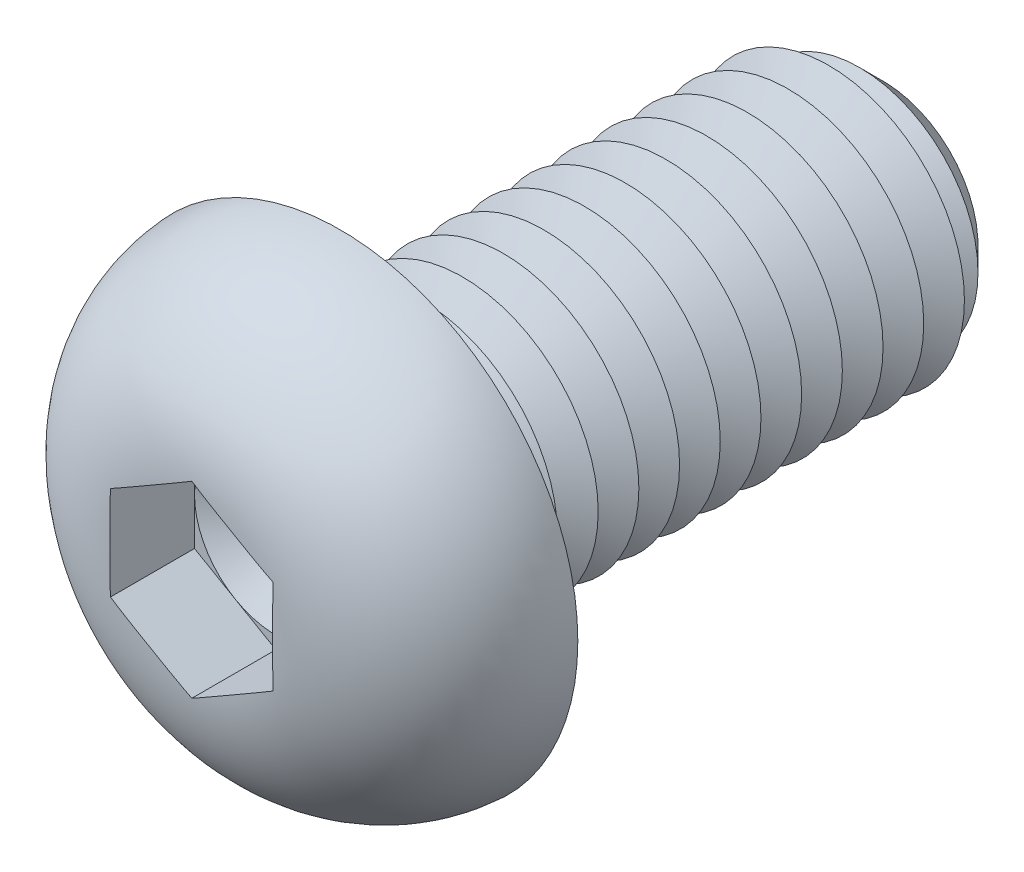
ISO-10303-21;
HEADER;
FILE_DESCRIPTION(('STEP AP214'),'2;1');
FILE_NAME('part.step','',(''),(''),'','','');
FILE_SCHEMA(('AUTOMOTIVE_DESIGN { 1 0 10303 214 1 1 1 1 }'));
ENDSEC;
DATA;
#1=APPLICATION_CONTEXT('core data for automotive mechanical design processes');
#2=APPLICATION_PROTOCOL_DEFINITION('international standard','automotive_design',2000,#1);
#3=PRODUCT_CONTEXT('',#1,'mechanical');
#4=PRODUCT('Part','Part','',(#3));
#5=PRODUCT_RELATED_PRODUCT_CATEGORY('part','',(#4));
#6=PRODUCT_DEFINITION_FORMATION('','',#4);
#7=PRODUCT_DEFINITION_CONTEXT('part definition',#1,'design');
#8=PRODUCT_DEFINITION('design','',#6,#7);
#9=PRODUCT_DEFINITION_SHAPE('','',#8);
#10=(LENGTH_UNIT() NAMED_UNIT(*) SI_UNIT(.MILLI.,.METRE.));
#11=(NAMED_UNIT(*) PLANE_ANGLE_UNIT() SI_UNIT($,.RADIAN.));
#12=(NAMED_UNIT(*) SI_UNIT($,.STERADIAN.) SOLID_ANGLE_UNIT());
#13=UNCERTAINTY_MEASURE_WITH_UNIT(LENGTH_MEASURE(1.E-05),#10,'distance_accuracy_value','');
#14=(GEOMETRIC_REPRESENTATION_CONTEXT(3) GLOBAL_UNCERTAINTY_ASSIGNED_CONTEXT((#13)) GLOBAL_UNIT_ASSIGNED_CONTEXT((#10,
#11,#12)) REPRESENTATION_CONTEXT('',''));
#15=CARTESIAN_POINT('',(0.,0.,0.));
#16=DIRECTION('',(0.,0.,1.));
#17=DIRECTION('',(1.,0.,0.));
#18=AXIS2_PLACEMENT_3D('',#15,#16,#17);
#19=CARTESIAN_POINT('',(0.,0.,2.38));
#20=DIRECTION('',(0.,0.,1.));
#21=DIRECTION('',(1.,0.,0.));
#22=AXIS2_PLACEMENT_3D('',#19,#20,#21);
#23=PLANE('',#22);
#24=CARTESIAN_POINT('',(0.,0.,2.38));
#25=DIRECTION('',(0.,0.,1.));
#26=DIRECTION('',(1.,0.,0.));
#27=AXIS2_PLACEMENT_3D('',#24,#25,#26);
#28=CIRCLE('',#27,3.);
#29=CARTESIAN_POINT('',(3.,0.,2.38));
#30=VERTEX_POINT('',#29);
#31=CARTESIAN_POINT('',(1.5,2.59807621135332,2.38));
#32=VERTEX_POINT('',#31);
#33=EDGE_CURVE('E117',#30,#32,#28,.T.);
#34=ORIENTED_EDGE('',*,*,#33,.F.);
#35=DIRECTION('',(0.,1.,0.));
#36=VECTOR('',#35,1.);
#37=CARTESIAN_POINT('',(3.,-1.73205080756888,2.38));
#38=LINE('',#37,#36);
#39=CARTESIAN_POINT('',(3.,1.73205080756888,2.38));
#40=VERTEX_POINT('',#39);
#41=EDGE_CURVE('E140',#30,#40,#38,.T.);
#42=ORIENTED_EDGE('',*,*,#41,.T.);
#43=DIRECTION('',(-0.866025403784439,0.5,0.));
#44=VECTOR('',#43,1.);
#45=CARTESIAN_POINT('',(3.,1.73205080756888,2.38));
#46=LINE('',#45,#44);
#47=EDGE_CURVE('E136',#40,#32,#46,.T.);
#48=ORIENTED_EDGE('',*,*,#47,.T.);
#49=EDGE_LOOP('',(#34,#42,#48));
#50=FACE_BOUND('',#49,.T.);
#51=ADVANCED_FACE('F39',(#50),#23,.T.);
#52=CARTESIAN_POINT('',(0.,0.,2.38));
#53=DIRECTION('',(0.,0.,1.));
#54=DIRECTION('',(1.,0.,0.));
#55=AXIS2_PLACEMENT_3D('',#52,#53,#54);
#56=CIRCLE('',#55,3.);
#57=CARTESIAN_POINT('',(-1.5,2.59807621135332,2.38));
#58=VERTEX_POINT('',#57);
#59=EDGE_CURVE('E11',#32,#58,#56,.T.);
#60=ORIENTED_EDGE('',*,*,#59,.F.);
#61=CARTESIAN_POINT('',(0.,3.46410161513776,2.38));
#62=VERTEX_POINT('',#61);
#63=EDGE_CURVE('E130',#32,#62,#46,.T.);
#64=ORIENTED_EDGE('',*,*,#63,.T.);
#65=DIRECTION('',(-0.866025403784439,-0.5,0.));
#66=VECTOR('',#65,1.);
#67=CARTESIAN_POINT('',(0.,3.46410161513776,2.38));
#68=LINE('',#67,#66);
#69=EDGE_CURVE('E131',#62,#58,#68,.T.);
#70=ORIENTED_EDGE('',*,*,#69,.T.);
#71=EDGE_LOOP('',(#60,#64,#70));
#72=FACE_BOUND('',#71,.T.);
#73=ADVANCED_FACE('F129',(#72),#23,.T.);
#74=CARTESIAN_POINT('',(-3.,0.,2.38));
#75=VERTEX_POINT('',#74);
#76=EDGE_CURVE('E49',#58,#75,#56,.T.);
#77=ORIENTED_EDGE('',*,*,#76,.F.);
#78=CARTESIAN_POINT('',(-3.,1.73205080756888,2.38));
#79=VERTEX_POINT('',#78);
#80=EDGE_CURVE('E143',#58,#79,#68,.T.);
#81=ORIENTED_EDGE('',*,*,#80,.T.);
#82=DIRECTION('',(0.,-1.,0.));
#83=VECTOR('',#82,1.);
#84=CARTESIAN_POINT('',(-3.,1.73205080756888,2.38));
#85=LINE('',#84,#83);
#86=EDGE_CURVE('E151',#79,#75,#85,.T.);
#87=ORIENTED_EDGE('',*,*,#86,.T.);
#88=EDGE_LOOP('',(#77,#81,#87));
#89=FACE_BOUND('',#88,.T.);
#90=ADVANCED_FACE('F275',(#89),#23,.T.);
#91=CARTESIAN_POINT('',(-1.5,-2.59807621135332,2.38));
#92=VERTEX_POINT('',#91);
#93=EDGE_CURVE('E257',#75,#92,#56,.T.);
#94=ORIENTED_EDGE('',*,*,#93,.F.);
#95=CARTESIAN_POINT('',(-3.,-1.73205080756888,2.38));
#96=VERTEX_POINT('',#95);
#97=EDGE_CURVE('E150',#75,#96,#85,.T.);
#98=ORIENTED_EDGE('',*,*,#97,.T.);
#99=DIRECTION('',(0.866025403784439,-0.5,0.));
#100=VECTOR('',#99,1.);
#101=CARTESIAN_POINT('',(-3.,-1.73205080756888,2.38));
#102=LINE('',#101,#100);
#103=EDGE_CURVE('E156',#96,#92,#102,.T.);
#104=ORIENTED_EDGE('',*,*,#103,.T.);
#105=EDGE_LOOP('',(#94,#98,#104));
#106=FACE_BOUND('',#105,.T.);
#107=ADVANCED_FACE('F269',(#106),#23,.T.);
#108=CARTESIAN_POINT('',(1.5,-2.59807621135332,2.38));
#109=VERTEX_POINT('',#108);
#110=EDGE_CURVE('E56',#92,#109,#56,.T.);
#111=ORIENTED_EDGE('',*,*,#110,.F.);
#112=CARTESIAN_POINT('',(0.,-3.46410161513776,2.38));
#113=VERTEX_POINT('',#112);
#114=EDGE_CURVE('E155',#92,#113,#102,.T.);
#115=ORIENTED_EDGE('',*,*,#114,.T.);
#116=DIRECTION('',(0.866025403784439,0.5,0.));
#117=VECTOR('',#116,1.);
#118=CARTESIAN_POINT('',(0.,-3.46410161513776,2.38));
#119=LINE('',#118,#117);
#120=EDGE_CURVE('E161',#113,#109,#119,.T.);
#121=ORIENTED_EDGE('',*,*,#120,.T.);
#122=EDGE_LOOP('',(#111,#115,#121));
#123=FACE_BOUND('',#122,.T.);
#124=ADVANCED_FACE('F310',(#123),#23,.T.);
#125=CARTESIAN_POINT('',(0.,0.,-20.));
#126=DIRECTION('',(0.,0.,1.));
#127=DIRECTION('',(1.,0.,0.));
#128=AXIS2_PLACEMENT_3D('',#125,#126,#127);
#129=CYLINDRICAL_SURFACE('',#128,5.);
#130=CARTESIAN_POINT('',(0.,0.,-0.6));
#131=DIRECTION('',(0.,0.,1.));
#132=DIRECTION('',(1.,0.,0.));
#133=AXIS2_PLACEMENT_3D('',#130,#131,#132);
#134=CIRCLE('',#133,5.);
#135=CARTESIAN_POINT('',(5.,0.,-0.6));
#136=VERTEX_POINT('',#135);
#137=EDGE_CURVE('E240',#136,#136,#134,.F.);
#138=ORIENTED_EDGE('',*,*,#137,.T.);
#139=EDGE_LOOP('',(#138));
#140=FACE_BOUND('',#139,.T.);
#141=CARTESIAN_POINT('',(0.,0.,-1.5));
#142=DIRECTION('',(0.,0.,1.));
#143=DIRECTION('',(1.,0.,0.));
#144=AXIS2_PLACEMENT_3D('',#141,#142,#143);
#145=CIRCLE('',#144,5.00000000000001);
#146=CARTESIAN_POINT('',(5.00000000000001,0.,-1.5));
#147=VERTEX_POINT('',#146);
#148=EDGE_CURVE('E138',#147,#147,#145,.T.);
#149=ORIENTED_EDGE('',*,*,#148,.T.);
#150=EDGE_LOOP('',(#149));
#151=FACE_BOUND('',#150,.T.);
#152=ADVANCED_FACE('F311',(#140,#151),#129,.T.);
#153=CARTESIAN_POINT('',(0.,8.75,0.));
#154=DIRECTION('',(0.,0.,1.));
#155=DIRECTION('',(1.,0.,0.));
#156=AXIS2_PLACEMENT_3D('',#153,#154,#155);
#157=PLANE('',#156);
#158=CARTESIAN_POINT('',(0.,0.,0.));
#159=DIRECTION('',(0.,0.,1.));
#160=DIRECTION('',(1.,0.,0.));
#161=AXIS2_PLACEMENT_3D('',#158,#159,#160);
#162=CIRCLE('',#161,5.6);
#163=CARTESIAN_POINT('',(5.6,0.,0.));
#164=VERTEX_POINT('',#163);
#165=EDGE_CURVE('E249',#164,#164,#162,.T.);
#166=ORIENTED_EDGE('',*,*,#165,.T.);
#167=EDGE_LOOP('',(#166));
#168=FACE_BOUND('',#167,.T.);
#169=CARTESIAN_POINT('',(0.,0.,0.));
#170=DIRECTION('',(0.,0.,1.));
#171=DIRECTION('',(1.,0.,0.));
#172=AXIS2_PLACEMENT_3D('',#169,#170,#171);
#173=CIRCLE('',#172,8.75);
#174=CARTESIAN_POINT('',(8.75,0.,0.));
#175=VERTEX_POINT('',#174);
#176=EDGE_CURVE('E172',#175,#175,#173,.T.);
#177=ORIENTED_EDGE('',*,*,#176,.F.);
#178=EDGE_LOOP('',(#177));
#179=FACE_BOUND('',#178,.T.);
#180=ADVANCED_FACE('F314',(#168,#179),#157,.F.);
#181=CARTESIAN_POINT('',(0.,0.,-0.3));
#182=DIRECTION('',(0.,0.,1.));
#183=DIRECTION('',(1.,0.,0.));
#184=AXIS2_PLACEMENT_3D('',#181,#182,#183);
#185=DEGENERATE_TOROIDAL_SURFACE('',#184,2.95776381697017,5.8,.T.);
#186=CARTESIAN_POINT('',(-3.0002,1.73193533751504,5.47784605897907));
#187=CARTESIAN_POINT('',(-2.87524340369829,1.80407906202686,5.4841525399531));
#188=CARTESIAN_POINT('',(-2.75023731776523,1.87625135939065,5.48853670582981));
#189=CARTESIAN_POINT('',(-2.5001955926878,2.02061301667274,5.49472046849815));
#190=CARTESIAN_POINT('',(-2.37515996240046,2.09280237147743,5.49652051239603));
#191=CARTESIAN_POINT('',(-2.12510741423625,2.23717027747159,5.4987972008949));
#192=CARTESIAN_POINT('',(-2.00009049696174,2.30934882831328,5.49927407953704));
#193=CARTESIAN_POINT('',(-1.75004905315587,2.45371032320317,5.49979859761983));
#194=CARTESIAN_POINT('',(-1.62502452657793,2.52589326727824,5.49984621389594));
#195=CARTESIAN_POINT('',(-1.37497547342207,2.67025915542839,5.49984621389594));
#196=CARTESIAN_POINT('',(-1.24995094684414,2.74244209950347,5.49979859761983));
#197=CARTESIAN_POINT('',(-0.999909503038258,2.88680359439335,5.49927407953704));
#198=CARTESIAN_POINT('',(-0.874892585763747,2.95898214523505,5.4987972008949));
#199=CARTESIAN_POINT('',(-0.624840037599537,3.10335005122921,5.49652051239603));
#200=CARTESIAN_POINT('',(-0.499804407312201,3.1755394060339,5.49472046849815));
#201=CARTESIAN_POINT('',(-0.249762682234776,3.31990106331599,5.48853670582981));
#202=CARTESIAN_POINT('',(-0.124756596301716,3.39207336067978,5.4841525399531));
#203=CARTESIAN_POINT('',(0.000199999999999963,3.46421708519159,5.47784605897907));
#204=B_SPLINE_CURVE_WITH_KNOTS('',3,(#186,#187,#188,#189,#190,#191,#192,#193,#194,#195,#196,
#197,#198,#199,#200,#201,#202,#203),.UNSPECIFIED.,.F.,.F.,(4,2,2,2,2,2,2,2,4),(0.,
0.433225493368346,0.866376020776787,1.29944992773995,1.73254720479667,2.16564448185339,
2.59871838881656,3.031868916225,3.46509440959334),.UNSPECIFIED.);
#205=CARTESIAN_POINT('',(-3.,1.73205080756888,5.4778561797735));
#206=VERTEX_POINT('',#205);
#207=CARTESIAN_POINT('',(0.,3.46410161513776,5.4778561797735));
#208=VERTEX_POINT('',#207);
#209=EDGE_CURVE('E194',#206,#208,#204,.T.);
#210=ORIENTED_EDGE('',*,*,#209,.T.);
#211=CARTESIAN_POINT('',(-0.000200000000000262,3.46421708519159,5.47784605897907));
#212=CARTESIAN_POINT('',(0.124756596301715,3.39207336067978,5.4841525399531));
#213=CARTESIAN_POINT('',(0.249762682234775,3.31990106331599,5.48853670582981));
#214=CARTESIAN_POINT('',(0.4998044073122,3.1755394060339,5.49472046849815));
#215=CARTESIAN_POINT('',(0.624840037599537,3.10335005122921,5.49652051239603));
#216=CARTESIAN_POINT('',(0.874892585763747,2.95898214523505,5.4987972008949));
#217=CARTESIAN_POINT('',(0.999909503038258,2.88680359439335,5.49927407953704));
#218=CARTESIAN_POINT('',(1.24995094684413,2.74244209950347,5.49979859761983));
#219=CARTESIAN_POINT('',(1.37497547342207,2.67025915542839,5.49984621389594));
#220=CARTESIAN_POINT('',(1.62502452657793,2.52589326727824,5.49984621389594));
#221=CARTESIAN_POINT('',(1.75004905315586,2.45371032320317,5.49979859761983));
#222=CARTESIAN_POINT('',(2.00009049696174,2.30934882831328,5.49927407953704));
#223=CARTESIAN_POINT('',(2.12510741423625,2.23717027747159,5.4987972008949));
#224=CARTESIAN_POINT('',(2.37515996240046,2.09280237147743,5.49652051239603));
#225=CARTESIAN_POINT('',(2.5001955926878,2.02061301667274,5.49472046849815));
#226=CARTESIAN_POINT('',(2.75023731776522,1.87625135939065,5.48853670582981));
#227=CARTESIAN_POINT('',(2.87524340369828,1.80407906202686,5.4841525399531));
#228=CARTESIAN_POINT('',(3.0002,1.73193533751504,5.47784605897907));
#229=B_SPLINE_CURVE_WITH_KNOTS('',3,(#211,#212,#213,#214,#215,#216,#217,#218,#219,#220,#221,
#222,#223,#224,#225,#226,#227,#228),.UNSPECIFIED.,.F.,.F.,(4,2,2,2,2,2,2,2,4),(0.,
0.433225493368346,0.866376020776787,1.29944992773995,1.73254720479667,2.16564448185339,
2.59871838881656,3.031868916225,3.46509440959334),.UNSPECIFIED.);
#230=CARTESIAN_POINT('',(3.,1.73205080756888,5.47785617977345));
#231=VERTEX_POINT('',#230);
#232=EDGE_CURVE('E223',#208,#231,#229,.T.);
#233=ORIENTED_EDGE('',*,*,#232,.T.);
#234=CARTESIAN_POINT('',(3.,0.,5.49984621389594));
#235=CARTESIAN_POINT('',(3.,-0.125570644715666,5.49984449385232));
#236=CARTESIAN_POINT('',(3.,-0.251141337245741,5.49980426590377));
#237=CARTESIAN_POINT('',(3.,-0.502283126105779,5.499449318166));
#238=CARTESIAN_POINT('',(3.,-0.62785422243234,5.49913459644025));
#239=CARTESIAN_POINT('',(3.,-0.879037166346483,5.49770394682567));
#240=CARTESIAN_POINT('',(3.,-1.00464901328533,5.49658774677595));
#241=CARTESIAN_POINT('',(3.,-1.2558477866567,5.49279605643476));
#242=CARTESIAN_POINT('',(3.,-1.38143471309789,5.49012056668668));
#243=CARTESIAN_POINT('',(3.,-1.7568847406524,5.47847778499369));
#244=CARTESIAN_POINT('',(3.,-2.00667103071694,5.46590367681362));
#245=CARTESIAN_POINT('',(3.,-2.50488375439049,5.42441448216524));
#246=CARTESIAN_POINT('',(3.,-2.75331093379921,5.3955095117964));
#247=CARTESIAN_POINT('',(3.,-3.18719021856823,5.32582626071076));
#248=CARTESIAN_POINT('',(3.,-3.3733635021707,5.28960049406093));
#249=CARTESIAN_POINT('',(3.,-3.74245496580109,5.20330651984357));
#250=CARTESIAN_POINT('',(3.,-3.92537417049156,5.15324275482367));
#251=CARTESIAN_POINT('',(3.,-4.28675502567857,5.03819885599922));
#252=CARTESIAN_POINT('',(3.,-4.46521058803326,4.97319946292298));
#253=CARTESIAN_POINT('',(3.,-4.81576789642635,4.82782766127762));
#254=CARTESIAN_POINT('',(3.,-4.98786985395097,4.74745576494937));
#255=CARTESIAN_POINT('',(3.,-5.3254008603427,4.5705398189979));
#256=CARTESIAN_POINT('',(3.,-5.49076268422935,4.47386710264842));
#257=CARTESIAN_POINT('',(3.,-5.81151175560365,4.26514040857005));
#258=CARTESIAN_POINT('',(3.,-5.96689840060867,4.15308550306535));
#259=CARTESIAN_POINT('',(3.,-6.26591787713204,3.91428862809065));
#260=CARTESIAN_POINT('',(3.,-6.40955257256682,3.78754899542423));
#261=CARTESIAN_POINT('',(3.,-6.68342295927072,3.52034797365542));
#262=CARTESIAN_POINT('',(3.,-6.81366070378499,3.3798886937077));
#263=CARTESIAN_POINT('',(3.,-7.0426666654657,3.10626157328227));
#264=CARTESIAN_POINT('',(3.,-7.1433109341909,2.97465879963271));
#265=CARTESIAN_POINT('',(3.,-7.33253056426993,2.70304716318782));
#266=CARTESIAN_POINT('',(3.,-7.42110686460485,2.56303895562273));
#267=CARTESIAN_POINT('',(3.,-7.58534868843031,2.27573732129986));
#268=CARTESIAN_POINT('',(3.,-7.66102067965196,2.12844759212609));
#269=CARTESIAN_POINT('',(3.,-7.79881901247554,1.82765987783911));
#270=CARTESIAN_POINT('',(3.,-7.86094563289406,1.67416202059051));
#271=CARTESIAN_POINT('',(3.,-7.96803488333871,1.37082076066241));
#272=CARTESIAN_POINT('',(3.,-8.01375687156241,1.22124490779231));
#273=CARTESIAN_POINT('',(3.,-8.09224398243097,0.918674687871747));
#274=CARTESIAN_POINT('',(3.,-8.12500479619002,0.765679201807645));
#275=CARTESIAN_POINT('',(3.,-8.17726457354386,0.457507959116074));
#276=CARTESIAN_POINT('',(3.,-8.1967692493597,0.302333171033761));
#277=CARTESIAN_POINT('',(3.,-8.22238322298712,-0.00917738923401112));
#278=CARTESIAN_POINT('',(3.,-8.22848754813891,-0.165513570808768));
#279=CARTESIAN_POINT('',(3.,-8.22724693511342,-0.475358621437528));
#280=CARTESIAN_POINT('',(3.,-8.2201384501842,-0.628868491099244));
#281=CARTESIAN_POINT('',(3.,-8.1929851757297,-0.934809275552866));
#282=CARTESIAN_POINT('',(3.,-8.17293462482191,-1.0872396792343));
#283=CARTESIAN_POINT('',(3.,-8.1200547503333,-1.38984943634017));
#284=CARTESIAN_POINT('',(3.,-8.08722683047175,-1.54002903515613));
#285=CARTESIAN_POINT('',(3.,-8.0090712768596,-1.83702738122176));
#286=CARTESIAN_POINT('',(3.,-7.96374919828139,-1.98384759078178));
#287=CARTESIAN_POINT('',(3.,-7.86096457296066,-2.27315566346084));
#288=CARTESIAN_POINT('',(3.,-7.80350334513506,-2.41564399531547));
#289=CARTESIAN_POINT('',(3.,-7.67691451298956,-2.6952770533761));
#290=CARTESIAN_POINT('',(3.,-7.60779108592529,-2.83242367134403));
#291=CARTESIAN_POINT('',(3.,-7.45837210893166,-3.10056990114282));
#292=CARTESIAN_POINT('',(3.,-7.37807144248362,-3.23156666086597));
#293=CARTESIAN_POINT('',(3.,-7.20697634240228,-3.48645411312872));
#294=CARTESIAN_POINT('',(3.,-7.11618520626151,-3.61034702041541));
#295=CARTESIAN_POINT('',(3.,-6.92334779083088,-3.85210954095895));
#296=CARTESIAN_POINT('',(3.,-6.82115263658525,-3.96986038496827));
#297=CARTESIAN_POINT('',(3.,-6.60745266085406,-4.19658717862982));
#298=CARTESIAN_POINT('',(3.,-6.49594754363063,-4.30556284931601));
#299=CARTESIAN_POINT('',(3.,-6.26450055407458,-4.51413072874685));
#300=CARTESIAN_POINT('',(3.,-6.14455919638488,-4.61372350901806));
#301=CARTESIAN_POINT('',(3.,-5.8971402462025,-4.80306090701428));
#302=CARTESIAN_POINT('',(3.,-5.76966228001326,-4.89280503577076));
#303=CARTESIAN_POINT('',(3.,-5.50268934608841,-5.06561354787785));
#304=CARTESIAN_POINT('',(3.,-5.36291526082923,-5.14824654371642));
#305=CARTESIAN_POINT('',(3.,-5.07726499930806,-5.30226841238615));
#306=CARTESIAN_POINT('',(3.,-4.93138704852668,-5.37365398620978));
#307=CARTESIAN_POINT('',(3.,-4.63484455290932,-5.50505544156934));
#308=CARTESIAN_POINT('',(3.,-4.48418671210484,-5.56508649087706));
#309=CARTESIAN_POINT('',(3.,-4.17906596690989,-5.6740700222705));
#310=CARTESIAN_POINT('',(3.,-4.02460600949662,-5.72303080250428));
#311=CARTESIAN_POINT('',(3.,-3.6739247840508,-5.82125760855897));
#312=CARTESIAN_POINT('',(3.,-3.47687521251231,-5.86756841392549));
#313=CARTESIAN_POINT('',(3.,-3.07981530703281,-5.94521593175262));
#314=CARTESIAN_POINT('',(3.,-2.87980357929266,-5.97654534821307));
#315=CARTESIAN_POINT('',(3.,-2.47751859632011,-6.02656554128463));
#316=CARTESIAN_POINT('',(3.,-2.27523974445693,-6.0452096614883));
#317=CARTESIAN_POINT('',(3.,-1.8700786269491,-6.07274849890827));
#318=CARTESIAN_POINT('',(3.,-1.66719636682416,-6.08164330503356));
#319=CARTESIAN_POINT('',(3.,-1.25887867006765,-6.09343726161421));
#320=CARTESIAN_POINT('',(3.,-1.05344157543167,-6.09626381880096));
#321=CARTESIAN_POINT('',(3.,-0.745285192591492,-6.0985660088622));
#322=CARTESIAN_POINT('',(3.,-0.642567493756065,-6.09901047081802));
#323=CARTESIAN_POINT('',(3.,-0.437131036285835,-6.09957976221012));
#324=CARTESIAN_POINT('',(3.,-0.334412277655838,-6.09970459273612));
#325=CARTESIAN_POINT('',(3.,-0.129132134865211,-6.09984385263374));
#326=CARTESIAN_POINT('',(3.,-0.0265707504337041,-6.09985845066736));
#327=CARTESIAN_POINT('',(3.,0.178552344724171,-6.09981980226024));
#328=CARTESIAN_POINT('',(3.,0.281114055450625,-6.09976655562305));
#329=CARTESIAN_POINT('',(3.,0.486235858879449,-6.09946703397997));
#330=CARTESIAN_POINT('',(3.,0.588795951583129,-6.0992207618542));
#331=CARTESIAN_POINT('',(3.,0.793913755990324,-6.09826017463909));
#332=CARTESIAN_POINT('',(3.,0.896471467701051,-6.097545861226));
#333=CARTESIAN_POINT('',(3.,1.11088851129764,-6.0951586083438));
#334=CARTESIAN_POINT('',(3.,1.22274716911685,-6.0934045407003));
#335=CARTESIAN_POINT('',(3.,1.44642575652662,-6.08829151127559));
#336=CARTESIAN_POINT('',(3.,1.55824568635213,-6.08493255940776));
#337=CARTESIAN_POINT('',(3.,1.89360474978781,-6.07150074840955));
#338=CARTESIAN_POINT('',(3.,2.11703989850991,-6.05807293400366));
#339=CARTESIAN_POINT('',(3.,2.56083256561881,-6.01778675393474));
#340=CARTESIAN_POINT('',(3.,2.78120000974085,-5.99104517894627));
#341=CARTESIAN_POINT('',(3.,3.2192866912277,-5.92065658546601));
#342=CARTESIAN_POINT('',(3.,3.43700630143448,-5.8770119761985));
#343=CARTESIAN_POINT('',(3.,3.82666678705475,-5.78060449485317));
#344=CARTESIAN_POINT('',(3.,3.99942726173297,-5.73116262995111));
#345=CARTESIAN_POINT('',(3.,4.3405567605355,-5.61888897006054));
#346=CARTESIAN_POINT('',(3.,4.50892617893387,-5.55605838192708));
#347=CARTESIAN_POINT('',(3.,4.84049143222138,-5.41635874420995));
#348=CARTESIAN_POINT('',(3.,5.00366586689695,-5.33943871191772));
#349=CARTESIAN_POINT('',(3.,5.32271829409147,-5.17167128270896));
#350=CARTESIAN_POINT('',(3.,5.47859600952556,-5.0808233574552));
#351=CARTESIAN_POINT('',(3.,5.7822829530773,-4.88500135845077));
#352=CARTESIAN_POINT('',(3.,5.93005015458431,-4.77996197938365));
#353=CARTESIAN_POINT('',(3.,6.21523046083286,-4.55663689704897));
#354=CARTESIAN_POINT('',(3.,6.35264336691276,-4.43835093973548));
#355=CARTESIAN_POINT('',(3.,6.61552762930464,-4.18948618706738));
#356=CARTESIAN_POINT('',(3.,6.74101380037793,-4.05892305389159));
#357=CARTESIAN_POINT('',(3.,6.97891308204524,-3.78639059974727));
#358=CARTESIAN_POINT('',(3.,7.09132750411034,-3.64442242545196));
#359=CARTESIAN_POINT('',(3.,7.29113623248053,-3.36530209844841));
#360=CARTESIAN_POINT('',(3.,7.37991316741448,-3.22913733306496));
#361=CARTESIAN_POINT('',(3.,7.5451968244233,-2.94955428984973));
#362=CARTESIAN_POINT('',(3.,7.62170419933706,-2.80613639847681));
#363=CARTESIAN_POINT('',(3.,7.76177641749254,-2.5131168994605));
#364=CARTESIAN_POINT('',(3.,7.82534152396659,-2.36351541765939));
#365=CARTESIAN_POINT('',(3.,7.93897019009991,-2.05926799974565));
#366=CARTESIAN_POINT('',(3.,7.98903395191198,-1.9046221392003));
#367=CARTESIAN_POINT('',(3.,8.07336540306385,-1.59821781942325));
#368=CARTESIAN_POINT('',(3.,8.10821878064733,-1.44662026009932));
#369=CARTESIAN_POINT('',(3.,8.16487862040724,-1.14095089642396));
#370=CARTESIAN_POINT('',(3.,8.18668070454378,-0.986878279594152));
#371=CARTESIAN_POINT('',(3.,8.21703234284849,-0.677515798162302));
#372=CARTESIAN_POINT('',(3.,8.22558889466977,-0.522226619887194));
#373=CARTESIAN_POINT('',(3.,8.22940229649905,-0.211427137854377));
#374=CARTESIAN_POINT('',(3.,8.22465425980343,-0.0559167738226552));
#375=CARTESIAN_POINT('',(3.,8.20204101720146,0.252033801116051));
#376=CARTESIAN_POINT('',(3.,8.18435378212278,0.404487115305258));
#377=CARTESIAN_POINT('',(3.,8.136196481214,0.707418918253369));
#378=CARTESIAN_POINT('',(3.,8.1057217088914,0.857896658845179));
#379=CARTESIAN_POINT('',(3.,8.03224632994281,1.15569567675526));
#380=CARTESIAN_POINT('',(3.,7.9892508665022,1.30301822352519));
#381=CARTESIAN_POINT('',(3.,7.89104818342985,1.59360769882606));
#382=CARTESIAN_POINT('',(3.,7.83583549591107,1.73687277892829));
#383=CARTESIAN_POINT('',(3.,7.71349498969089,2.01864020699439));
#384=CARTESIAN_POINT('',(3.,7.64633814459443,2.1571299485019));
#385=CARTESIAN_POINT('',(3.,7.50076383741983,2.42797950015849));
#386=CARTESIAN_POINT('',(3.,7.42235122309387,2.56034191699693));
#387=CARTESIAN_POINT('',(3.,7.25483284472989,2.8181715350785));
#388=CARTESIAN_POINT('',(3.,7.16572386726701,2.94363664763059));
#389=CARTESIAN_POINT('',(3.,6.9775559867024,3.1867979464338));
#390=CARTESIAN_POINT('',(3.,6.87850037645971,3.30449668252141));
#391=CARTESIAN_POINT('',(3.,6.66919743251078,3.53363644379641));
#392=CARTESIAN_POINT('',(3.,6.55877281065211,3.6449154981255));
#393=CARTESIAN_POINT('',(3.,6.32925753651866,3.85806320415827));
#394=CARTESIAN_POINT('',(3.,6.21016952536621,3.95993470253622));
#395=CARTESIAN_POINT('',(3.,5.96413069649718,4.15386505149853));
#396=CARTESIAN_POINT('',(3.,5.83717459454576,4.24591719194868));
#397=CARTESIAN_POINT('',(3.,5.5764653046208,4.41973423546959));
#398=CARTESIAN_POINT('',(3.,5.4427139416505,4.50150188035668));
#399=CARTESIAN_POINT('',(3.,5.16249709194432,4.65840017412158));
#400=CARTESIAN_POINT('',(3.,5.01573037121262,4.73299250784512));
#401=CARTESIAN_POINT('',(3.,4.71685583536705,4.87057528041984));
#402=CARTESIAN_POINT('',(3.,4.56474751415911,4.93356461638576));
#403=CARTESIAN_POINT('',(3.,4.25657035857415,5.04801407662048));
#404=CARTESIAN_POINT('',(3.,4.10050882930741,5.09949395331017));
#405=CARTESIAN_POINT('',(3.,3.78523286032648,5.19149003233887));
#406=CARTESIAN_POINT('',(3.,3.62601895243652,5.23200806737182));
#407=CARTESIAN_POINT('',(3.,3.32461902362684,5.29856444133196));
#408=CARTESIAN_POINT('',(3.,3.18268434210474,5.32575733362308));
#409=CARTESIAN_POINT('',(3.,2.89760844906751,5.3729307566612));
#410=CARTESIAN_POINT('',(3.,2.75446703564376,5.39291005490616));
#411=CARTESIAN_POINT('',(3.,2.46730946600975,5.42656527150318));
#412=CARTESIAN_POINT('',(3.,2.32329255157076,5.44023457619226));
#413=CARTESIAN_POINT('',(3.,2.03487642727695,5.46234228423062));
#414=CARTESIAN_POINT('',(3.,1.89047722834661,5.4707808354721));
#415=CARTESIAN_POINT('',(3.,1.60058090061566,5.48373897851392));
#416=CARTESIAN_POINT('',(3.,1.45508270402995,5.48823290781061));
#417=CARTESIAN_POINT('',(3.,1.16402671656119,5.49458098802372));
#418=CARTESIAN_POINT('',(3.,1.01846892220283,5.49643495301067));
#419=CARTESIAN_POINT('',(3.,0.72742451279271,5.49877506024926));
#420=CARTESIAN_POINT('',(3.,0.581937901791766,5.49926194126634));
#421=CARTESIAN_POINT('',(3.,0.290967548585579,5.49979850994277));
#422=CARTESIAN_POINT('',(3.,0.145483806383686,5.49984820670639));
#423=CARTESIAN_POINT('',(3.,0.,5.49984621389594));
#424=B_SPLINE_CURVE_WITH_KNOTS('',3,(#234,#235,#236,#237,#238,#239,#240,#241,#242,#243,#244,
#245,#246,#247,#248,#249,#250,#251,#252,#253,#254,#255,#256,#257,#258,#259,#260,#261,#262,#263,
#264,#265,#266,#267,#268,#269,#270,#271,#272,#273,#274,#275,#276,#277,#278,#279,#280,#281,#282,
#283,#284,#285,#286,#287,#288,#289,#290,#291,#292,#293,#294,#295,#296,#297,#298,#299,#300,#301,
#302,#303,#304,#305,#306,#307,#308,#309,#310,#311,#312,#313,#314,#315,#316,#317,#318,#319,#320,
#321,#322,#323,#324,#325,#326,#327,#328,#329,#330,#331,#332,#333,#334,#335,#336,#337,#338,#339,
#340,#341,#342,#343,#344,#345,#346,#347,#348,#349,#350,#351,#352,#353,#354,#355,#356,#357,#358,
#359,#360,#361,#362,#363,#364,#365,#366,#367,#368,#369,#370,#371,#372,#373,#374,#375,#376,#377,
#378,#379,#380,#381,#382,#383,#384,#385,#386,#387,#388,#389,#390,#391,#392,#393,#394,#395,#396,
#397,#398,#399,#400,#401,#402,#403,#404,#405,#406,#407,#408,#409,#410,#411,#412,#413,#414,#415,
#416,#417,#418,#419,#420,#421,#422,#423),.UNSPECIFIED.,.T.,.F.,(4,2,2,2,2,2,2,2,2,2,2,2,2,2,2,2,
2,2,2,2,2,2,2,2,2,2,2,2,2,2,2,2,2,2,2,2,2,2,2,2,2,2,2,2,2,2,2,2,2,2,2,2,2,2,2,2,2,2,2,2,2,2,2,2,
2,2,2,2,2,2,2,2,2,2,2,2,2,2,2,2,2,2,2,2,2,2,2,2,2,2,2,2,2,2,4),(0.,0.376711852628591,
0.753426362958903,1.13026885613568,1.50711121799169,2.257095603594,3.00661592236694,
3.57514719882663,4.14349616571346,4.71258216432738,5.28164920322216,5.85543852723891,
6.42926247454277,7.00299523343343,7.57663992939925,8.07303876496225,8.56939895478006,
9.06550962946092,9.56161009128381,10.030267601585,10.4990807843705,10.9676918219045,
11.4364767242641,11.8969530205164,12.3576344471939,12.8182652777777,13.2786916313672,
13.7390679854,14.1992797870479,14.6597029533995,15.1199817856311,15.5871904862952,
16.0544140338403,16.5216091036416,16.9888273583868,17.4754224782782,17.9621600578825,
18.4482427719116,18.9339599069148,19.5405320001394,20.1473991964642,20.7564865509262,
21.3655683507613,21.9818967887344,22.2900536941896,22.5982095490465,22.905893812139,
23.2135789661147,23.5212595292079,23.8289389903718,24.1645461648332,24.5001512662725,
25.171371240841,25.8368042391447,26.5021424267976,27.0407309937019,27.5792710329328,
28.119799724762,28.660348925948,29.2034761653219,29.7466138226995,30.2890677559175,
30.831467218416,31.3185063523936,31.8055195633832,32.2925228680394,32.779518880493,
33.2456153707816,33.7118681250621,34.1778744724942,34.6440520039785,35.103935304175,
35.563988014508,36.0238520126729,36.4839222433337,36.9451261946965,37.4061321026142,
37.8672768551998,38.3282694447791,38.7980460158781,39.2676799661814,39.7376328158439,
40.207460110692,40.7008436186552,41.1942739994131,41.6868509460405,42.1793454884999,
42.6126940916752,43.0461167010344,43.479992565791,43.9138561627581,44.3505218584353,
44.7872183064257,45.2236787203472,45.6601300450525),.UNSPECIFIED.);
#425=CARTESIAN_POINT('',(3.,-1.73205080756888,5.4778561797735));
#426=VERTEX_POINT('',#425);
#427=EDGE_CURVE('E232',#231,#426,#424,.T.);
#428=ORIENTED_EDGE('',*,*,#427,.T.);
#429=CARTESIAN_POINT('',(3.0002,-1.73193533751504,5.47784605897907));
#430=CARTESIAN_POINT('',(2.87524340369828,-1.80407906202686,5.4841525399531));
#431=CARTESIAN_POINT('',(2.75023731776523,-1.87625135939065,5.48853670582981));
#432=CARTESIAN_POINT('',(2.5001955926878,-2.02061301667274,5.49472046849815));
#433=CARTESIAN_POINT('',(2.37515996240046,-2.09280237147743,5.49652051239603));
#434=CARTESIAN_POINT('',(2.12510741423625,-2.23717027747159,5.4987972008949));
#435=CARTESIAN_POINT('',(2.00009049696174,-2.30934882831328,5.49927407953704));
#436=CARTESIAN_POINT('',(1.75004905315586,-2.45371032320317,5.49979859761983));
#437=CARTESIAN_POINT('',(1.62502452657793,-2.52589326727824,5.49984621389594));
#438=CARTESIAN_POINT('',(1.37497547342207,-2.67025915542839,5.49984621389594));
#439=CARTESIAN_POINT('',(1.24995094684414,-2.74244209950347,5.49979859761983));
#440=CARTESIAN_POINT('',(0.999909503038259,-2.88680359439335,5.49927407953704));
#441=CARTESIAN_POINT('',(0.874892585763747,-2.95898214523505,5.4987972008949));
#442=CARTESIAN_POINT('',(0.624840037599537,-3.10335005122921,5.49652051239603));
#443=CARTESIAN_POINT('',(0.499804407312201,-3.1755394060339,5.49472046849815));
#444=CARTESIAN_POINT('',(0.249762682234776,-3.31990106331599,5.48853670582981));
#445=CARTESIAN_POINT('',(0.124756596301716,-3.39207336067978,5.4841525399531));
#446=CARTESIAN_POINT('',(-0.000199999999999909,-3.46421708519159,5.47784605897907));
#447=B_SPLINE_CURVE_WITH_KNOTS('',3,(#429,#430,#431,#432,#433,#434,#435,#436,#437,#438,#439,
#440,#441,#442,#443,#444,#445,#446),.UNSPECIFIED.,.F.,.F.,(4,2,2,2,2,2,2,2,4),(0.,
0.433225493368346,0.866376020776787,1.29944992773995,1.73254720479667,2.16564448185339,
2.59871838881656,3.031868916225,3.46509440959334),.UNSPECIFIED.);
#448=CARTESIAN_POINT('',(0.,-3.46410161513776,5.4778561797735));
#449=VERTEX_POINT('',#448);
#450=EDGE_CURVE('E285',#426,#449,#447,.T.);
#451=ORIENTED_EDGE('',*,*,#450,.T.);
#452=CARTESIAN_POINT('',(0.000200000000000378,-3.46421708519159,5.47784605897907));
#453=CARTESIAN_POINT('',(-0.124756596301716,-3.39207336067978,5.4841525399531));
#454=CARTESIAN_POINT('',(-0.249762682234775,-3.31990106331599,5.48853670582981));
#455=CARTESIAN_POINT('',(-0.499804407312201,-3.1755394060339,5.49472046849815));
#456=CARTESIAN_POINT('',(-0.624840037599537,-3.10335005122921,5.49652051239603));
#457=CARTESIAN_POINT('',(-0.874892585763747,-2.95898214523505,5.4987972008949));
#458=CARTESIAN_POINT('',(-0.999909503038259,-2.88680359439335,5.49927407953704));
#459=CARTESIAN_POINT('',(-1.24995094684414,-2.74244209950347,5.49979859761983));
#460=CARTESIAN_POINT('',(-1.37497547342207,-2.67025915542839,5.49984621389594));
#461=CARTESIAN_POINT('',(-1.62502452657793,-2.52589326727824,5.49984621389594));
#462=CARTESIAN_POINT('',(-1.75004905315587,-2.45371032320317,5.49979859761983));
#463=CARTESIAN_POINT('',(-2.00009049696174,-2.30934882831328,5.49927407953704));
#464=CARTESIAN_POINT('',(-2.12510741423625,-2.23717027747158,5.4987972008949));
#465=CARTESIAN_POINT('',(-2.37515996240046,-2.09280237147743,5.49652051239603));
#466=CARTESIAN_POINT('',(-2.5001955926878,-2.02061301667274,5.49472046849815));
#467=CARTESIAN_POINT('',(-2.75023731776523,-1.87625135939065,5.48853670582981));
#468=CARTESIAN_POINT('',(-2.87524340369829,-1.80407906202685,5.4841525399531));
#469=CARTESIAN_POINT('',(-3.0002,-1.73193533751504,5.47784605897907));
#470=B_SPLINE_CURVE_WITH_KNOTS('',3,(#452,#453,#454,#455,#456,#457,#458,#459,#460,#461,#462,
#463,#464,#465,#466,#467,#468,#469),.UNSPECIFIED.,.F.,.F.,(4,2,2,2,2,2,2,2,4),(0.,
0.433225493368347,0.866376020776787,1.29944992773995,1.73254720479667,2.16564448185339,
2.59871838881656,3.031868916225,3.46509440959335),.UNSPECIFIED.);
#471=CARTESIAN_POINT('',(-3.,-1.73205080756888,5.47785617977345));
#472=VERTEX_POINT('',#471);
#473=EDGE_CURVE('E282',#449,#472,#470,.T.);
#474=ORIENTED_EDGE('',*,*,#473,.T.);
#475=CARTESIAN_POINT('',(-3.,0.,5.49984621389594));
#476=CARTESIAN_POINT('',(-3.,0.125570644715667,5.49984449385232));
#477=CARTESIAN_POINT('',(-3.,0.251141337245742,5.49980426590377));
#478=CARTESIAN_POINT('',(-3.,0.50228312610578,5.499449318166));
#479=CARTESIAN_POINT('',(-3.,0.627854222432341,5.49913459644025));
#480=CARTESIAN_POINT('',(-3.,0.879037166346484,5.49770394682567));
#481=CARTESIAN_POINT('',(-3.,1.00464901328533,5.49658774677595));
#482=CARTESIAN_POINT('',(-3.,1.2558477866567,5.49279605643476));
#483=CARTESIAN_POINT('',(-3.,1.3814347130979,5.49012056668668));
#484=CARTESIAN_POINT('',(-3.,1.7568847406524,5.47847778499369));
#485=CARTESIAN_POINT('',(-3.,2.00667103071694,5.46590367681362));
#486=CARTESIAN_POINT('',(-3.,2.50488375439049,5.42441448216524));
#487=CARTESIAN_POINT('',(-3.,2.75331093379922,5.3955095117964));
#488=CARTESIAN_POINT('',(-3.,3.18719021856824,5.32582626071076));
#489=CARTESIAN_POINT('',(-3.,3.3733635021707,5.28960049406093));
#490=CARTESIAN_POINT('',(-3.,3.74245496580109,5.20330651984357));
#491=CARTESIAN_POINT('',(-3.,3.92537417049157,5.15324275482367));
#492=CARTESIAN_POINT('',(-3.,4.28675502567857,5.03819885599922));
#493=CARTESIAN_POINT('',(-3.,4.46521058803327,4.97319946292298));
#494=CARTESIAN_POINT('',(-3.,4.81576789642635,4.82782766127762));
#495=CARTESIAN_POINT('',(-3.,4.98786985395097,4.74745576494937));
#496=CARTESIAN_POINT('',(-3.,5.3254008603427,4.5705398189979));
#497=CARTESIAN_POINT('',(-3.,5.49076268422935,4.47386710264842));
#498=CARTESIAN_POINT('',(-3.,5.81151175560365,4.26514040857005));
#499=CARTESIAN_POINT('',(-3.,5.96689840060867,4.15308550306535));
#500=CARTESIAN_POINT('',(-3.,6.26591787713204,3.91428862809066));
#501=CARTESIAN_POINT('',(-3.,6.40955257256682,3.78754899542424));
#502=CARTESIAN_POINT('',(-3.,6.68342295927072,3.52034797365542));
#503=CARTESIAN_POINT('',(-3.,6.81366070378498,3.3798886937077));
#504=CARTESIAN_POINT('',(-3.,7.0426666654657,3.10626157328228));
#505=CARTESIAN_POINT('',(-3.,7.14331093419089,2.97465879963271));
#506=CARTESIAN_POINT('',(-3.,7.33253056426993,2.70304716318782));
#507=CARTESIAN_POINT('',(-3.,7.42110686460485,2.56303895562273));
#508=CARTESIAN_POINT('',(-3.,7.58534868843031,2.27573732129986));
#509=CARTESIAN_POINT('',(-3.,7.66102067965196,2.12844759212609));
#510=CARTESIAN_POINT('',(-3.,7.79881901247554,1.82765987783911));
#511=CARTESIAN_POINT('',(-3.,7.86094563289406,1.67416202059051));
#512=CARTESIAN_POINT('',(-3.,7.96803488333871,1.37082076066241));
#513=CARTESIAN_POINT('',(-3.,8.01375687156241,1.22124490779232));
#514=CARTESIAN_POINT('',(-3.,8.09224398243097,0.918674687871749));
#515=CARTESIAN_POINT('',(-3.,8.12500479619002,0.765679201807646));
#516=CARTESIAN_POINT('',(-3.,8.17726457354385,0.457507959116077));
#517=CARTESIAN_POINT('',(-3.,8.1967692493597,0.302333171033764));
#518=CARTESIAN_POINT('',(-3.,8.22238322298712,-0.00917738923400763));
#519=CARTESIAN_POINT('',(-3.,8.22848754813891,-0.165513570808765));
#520=CARTESIAN_POINT('',(-3.,8.22724693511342,-0.475358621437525));
#521=CARTESIAN_POINT('',(-3.,8.2201384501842,-0.628868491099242));
#522=CARTESIAN_POINT('',(-3.,8.1929851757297,-0.934809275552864));
#523=CARTESIAN_POINT('',(-3.,8.17293462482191,-1.08723967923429));
#524=CARTESIAN_POINT('',(-3.,8.1200547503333,-1.38984943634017));
#525=CARTESIAN_POINT('',(-3.,8.08722683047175,-1.54002903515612));
#526=CARTESIAN_POINT('',(-3.,8.0090712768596,-1.83702738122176));
#527=CARTESIAN_POINT('',(-3.,7.96374919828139,-1.98384759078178));
#528=CARTESIAN_POINT('',(-3.,7.86096457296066,-2.27315566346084));
#529=CARTESIAN_POINT('',(-3.,7.80350334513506,-2.41564399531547));
#530=CARTESIAN_POINT('',(-3.,7.67691451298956,-2.69527705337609));
#531=CARTESIAN_POINT('',(-3.,7.60779108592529,-2.83242367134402));
#532=CARTESIAN_POINT('',(-3.,7.45837210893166,-3.10056990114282));
#533=CARTESIAN_POINT('',(-3.,7.37807144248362,-3.23156666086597));
#534=CARTESIAN_POINT('',(-3.,7.20697634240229,-3.48645411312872));
#535=CARTESIAN_POINT('',(-3.,7.11618520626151,-3.61034702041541));
#536=CARTESIAN_POINT('',(-3.,6.92334779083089,-3.85210954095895));
#537=CARTESIAN_POINT('',(-3.,6.82115263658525,-3.96986038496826));
#538=CARTESIAN_POINT('',(-3.,6.60745266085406,-4.19658717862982));
#539=CARTESIAN_POINT('',(-3.,6.49594754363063,-4.30556284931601));
#540=CARTESIAN_POINT('',(-3.,6.26450055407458,-4.51413072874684));
#541=CARTESIAN_POINT('',(-3.,6.14455919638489,-4.61372350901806));
#542=CARTESIAN_POINT('',(-3.,5.8971402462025,-4.80306090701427));
#543=CARTESIAN_POINT('',(-3.,5.76966228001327,-4.89280503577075));
#544=CARTESIAN_POINT('',(-3.,5.50268934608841,-5.06561354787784));
#545=CARTESIAN_POINT('',(-3.,5.36291526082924,-5.14824654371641));
#546=CARTESIAN_POINT('',(-3.,5.07726499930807,-5.30226841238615));
#547=CARTESIAN_POINT('',(-3.,4.93138704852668,-5.37365398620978));
#548=CARTESIAN_POINT('',(-3.,4.63484455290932,-5.50505544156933));
#549=CARTESIAN_POINT('',(-3.,4.48418671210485,-5.56508649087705));
#550=CARTESIAN_POINT('',(-3.,4.17906596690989,-5.6740700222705));
#551=CARTESIAN_POINT('',(-3.,4.02460600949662,-5.72303080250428));
#552=CARTESIAN_POINT('',(-3.,3.6739247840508,-5.82125760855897));
#553=CARTESIAN_POINT('',(-3.,3.47687521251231,-5.86756841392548));
#554=CARTESIAN_POINT('',(-3.,3.07981530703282,-5.94521593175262));
#555=CARTESIAN_POINT('',(-3.,2.87980357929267,-5.97654534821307));
#556=CARTESIAN_POINT('',(-3.,2.47751859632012,-6.02656554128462));
#557=CARTESIAN_POINT('',(-3.,2.27523974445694,-6.0452096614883));
#558=CARTESIAN_POINT('',(-3.,1.87007862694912,-6.07274849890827));
#559=CARTESIAN_POINT('',(-3.,1.66719636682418,-6.08164330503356));
#560=CARTESIAN_POINT('',(-3.,1.25887867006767,-6.09343726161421));
#561=CARTESIAN_POINT('',(-3.,1.05344157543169,-6.09626381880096));
#562=CARTESIAN_POINT('',(-3.,0.745285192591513,-6.0985660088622));
#563=CARTESIAN_POINT('',(-3.,0.642567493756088,-6.09901047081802));
#564=CARTESIAN_POINT('',(-3.,0.437131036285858,-6.09957976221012));
#565=CARTESIAN_POINT('',(-3.,0.334412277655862,-6.09970459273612));
#566=CARTESIAN_POINT('',(-3.,0.129132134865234,-6.09984385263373));
#567=CARTESIAN_POINT('',(-3.,0.0265707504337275,-6.09985845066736));
#568=CARTESIAN_POINT('',(-3.,-0.178552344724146,-6.09981980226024));
#569=CARTESIAN_POINT('',(-3.,-0.281114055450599,-6.09976655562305));
#570=CARTESIAN_POINT('',(-3.,-0.486235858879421,-6.09946703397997));
#571=CARTESIAN_POINT('',(-3.,-0.588795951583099,-6.0992207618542));
#572=CARTESIAN_POINT('',(-3.,-0.793913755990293,-6.09826017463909));
#573=CARTESIAN_POINT('',(-3.,-0.89647146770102,-6.097545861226));
#574=CARTESIAN_POINT('',(-3.,-1.11088851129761,-6.0951586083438));
#575=CARTESIAN_POINT('',(-3.,-1.22274716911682,-6.0934045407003));
#576=CARTESIAN_POINT('',(-3.,-1.44642575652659,-6.08829151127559));
#577=CARTESIAN_POINT('',(-3.,-1.55824568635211,-6.08493255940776));
#578=CARTESIAN_POINT('',(-3.,-1.89360474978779,-6.07150074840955));
#579=CARTESIAN_POINT('',(-3.,-2.11703989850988,-6.05807293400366));
#580=CARTESIAN_POINT('',(-3.,-2.56083256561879,-6.01778675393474));
#581=CARTESIAN_POINT('',(-3.,-2.78120000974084,-5.99104517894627));
#582=CARTESIAN_POINT('',(-3.,-3.21928669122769,-5.92065658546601));
#583=CARTESIAN_POINT('',(-3.,-3.43700630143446,-5.8770119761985));
#584=CARTESIAN_POINT('',(-3.,-3.82666678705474,-5.78060449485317));
#585=CARTESIAN_POINT('',(-3.,-3.99942726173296,-5.73116262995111));
#586=CARTESIAN_POINT('',(-3.,-4.34055676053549,-5.61888897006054));
#587=CARTESIAN_POINT('',(-3.,-4.50892617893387,-5.55605838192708));
#588=CARTESIAN_POINT('',(-3.,-4.84049143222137,-5.41635874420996));
#589=CARTESIAN_POINT('',(-3.,-5.00366586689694,-5.33943871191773));
#590=CARTESIAN_POINT('',(-3.,-5.32271829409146,-5.17167128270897));
#591=CARTESIAN_POINT('',(-3.,-5.47859600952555,-5.08082335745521));
#592=CARTESIAN_POINT('',(-3.,-5.78228295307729,-4.88500135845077));
#593=CARTESIAN_POINT('',(-3.,-5.9300501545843,-4.77996197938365));
#594=CARTESIAN_POINT('',(-3.,-6.21523046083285,-4.55663689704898));
#595=CARTESIAN_POINT('',(-3.,-6.35264336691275,-4.43835093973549));
#596=CARTESIAN_POINT('',(-3.,-6.61552762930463,-4.18948618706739));
#597=CARTESIAN_POINT('',(-3.,-6.74101380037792,-4.05892305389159));
#598=CARTESIAN_POINT('',(-3.,-6.97891308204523,-3.78639059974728));
#599=CARTESIAN_POINT('',(-3.,-7.09132750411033,-3.64442242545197));
#600=CARTESIAN_POINT('',(-3.,-7.29113623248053,-3.36530209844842));
#601=CARTESIAN_POINT('',(-3.,-7.37991316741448,-3.22913733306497));
#602=CARTESIAN_POINT('',(-3.,-7.54519682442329,-2.94955428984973));
#603=CARTESIAN_POINT('',(-3.,-7.62170419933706,-2.80613639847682));
#604=CARTESIAN_POINT('',(-3.,-7.76177641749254,-2.5131168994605));
#605=CARTESIAN_POINT('',(-3.,-7.82534152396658,-2.3635154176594));
#606=CARTESIAN_POINT('',(-3.,-7.93897019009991,-2.05926799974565));
#607=CARTESIAN_POINT('',(-3.,-7.98903395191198,-1.9046221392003));
#608=CARTESIAN_POINT('',(-3.,-8.07336540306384,-1.59821781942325));
#609=CARTESIAN_POINT('',(-3.,-8.10821878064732,-1.44662026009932));
#610=CARTESIAN_POINT('',(-3.,-8.16487862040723,-1.14095089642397));
#611=CARTESIAN_POINT('',(-3.,-8.18668070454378,-0.986878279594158));
#612=CARTESIAN_POINT('',(-3.,-8.21703234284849,-0.677515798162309));
#613=CARTESIAN_POINT('',(-3.,-8.22558889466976,-0.522226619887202));
#614=CARTESIAN_POINT('',(-3.,-8.22940229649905,-0.211427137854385));
#615=CARTESIAN_POINT('',(-3.,-8.22465425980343,-0.0559167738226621));
#616=CARTESIAN_POINT('',(-3.,-8.20204101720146,0.252033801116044));
#617=CARTESIAN_POINT('',(-3.,-8.18435378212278,0.40448711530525));
#618=CARTESIAN_POINT('',(-3.,-8.136196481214,0.707418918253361));
#619=CARTESIAN_POINT('',(-3.,-8.1057217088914,0.857896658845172));
#620=CARTESIAN_POINT('',(-3.,-8.03224632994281,1.15569567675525));
#621=CARTESIAN_POINT('',(-3.,-7.9892508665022,1.30301822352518));
#622=CARTESIAN_POINT('',(-3.,-7.89104818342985,1.59360769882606));
#623=CARTESIAN_POINT('',(-3.,-7.83583549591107,1.73687277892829));
#624=CARTESIAN_POINT('',(-3.,-7.71349498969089,2.01864020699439));
#625=CARTESIAN_POINT('',(-3.,-7.64633814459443,2.1571299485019));
#626=CARTESIAN_POINT('',(-3.,-7.50076383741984,2.42797950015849));
#627=CARTESIAN_POINT('',(-3.,-7.42235122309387,2.56034191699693));
#628=CARTESIAN_POINT('',(-3.,-7.25483284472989,2.81817153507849));
#629=CARTESIAN_POINT('',(-3.,-7.16572386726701,2.94363664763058));
#630=CARTESIAN_POINT('',(-3.,-6.97755598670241,3.1867979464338));
#631=CARTESIAN_POINT('',(-3.,-6.87850037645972,3.30449668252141));
#632=CARTESIAN_POINT('',(-3.,-6.66919743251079,3.53363644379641));
#633=CARTESIAN_POINT('',(-3.,-6.55877281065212,3.64491549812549));
#634=CARTESIAN_POINT('',(-3.,-6.32925753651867,3.85806320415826));
#635=CARTESIAN_POINT('',(-3.,-6.21016952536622,3.95993470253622));
#636=CARTESIAN_POINT('',(-3.,-5.96413069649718,4.15386505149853));
#637=CARTESIAN_POINT('',(-3.,-5.83717459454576,4.24591719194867));
#638=CARTESIAN_POINT('',(-3.,-5.5764653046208,4.41973423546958));
#639=CARTESIAN_POINT('',(-3.,-5.4427139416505,4.50150188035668));
#640=CARTESIAN_POINT('',(-3.,-5.16249709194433,4.65840017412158));
#641=CARTESIAN_POINT('',(-3.,-5.01573037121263,4.73299250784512));
#642=CARTESIAN_POINT('',(-3.,-4.71685583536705,4.87057528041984));
#643=CARTESIAN_POINT('',(-3.,-4.56474751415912,4.93356461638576));
#644=CARTESIAN_POINT('',(-3.,-4.25657035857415,5.04801407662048));
#645=CARTESIAN_POINT('',(-3.,-4.10050882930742,5.09949395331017));
#646=CARTESIAN_POINT('',(-3.,-3.78523286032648,5.19149003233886));
#647=CARTESIAN_POINT('',(-3.,-3.62601895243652,5.23200806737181));
#648=CARTESIAN_POINT('',(-3.,-3.32461902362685,5.29856444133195));
#649=CARTESIAN_POINT('',(-3.,-3.18268434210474,5.32575733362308));
#650=CARTESIAN_POINT('',(-3.,-2.89760844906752,5.3729307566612));
#651=CARTESIAN_POINT('',(-3.,-2.75446703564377,5.39291005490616));
#652=CARTESIAN_POINT('',(-3.,-2.46730946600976,5.42656527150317));
#653=CARTESIAN_POINT('',(-3.,-2.32329255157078,5.44023457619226));
#654=CARTESIAN_POINT('',(-3.,-2.03487642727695,5.46234228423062));
#655=CARTESIAN_POINT('',(-3.,-1.89047722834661,5.4707808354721));
#656=CARTESIAN_POINT('',(-3.,-1.60058090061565,5.48373897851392));
#657=CARTESIAN_POINT('',(-3.,-1.45508270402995,5.48823290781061));
#658=CARTESIAN_POINT('',(-3.,-1.16402671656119,5.49458098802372));
#659=CARTESIAN_POINT('',(-3.,-1.01846892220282,5.49643495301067));
#660=CARTESIAN_POINT('',(-3.,-0.727424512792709,5.49877506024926));
#661=CARTESIAN_POINT('',(-3.,-0.581937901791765,5.49926194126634));
#662=CARTESIAN_POINT('',(-3.,-0.290967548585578,5.49979850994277));
#663=CARTESIAN_POINT('',(-3.,-0.145483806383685,5.49984820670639));
#664=CARTESIAN_POINT('',(-3.,0.,5.49984621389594));
#665=B_SPLINE_CURVE_WITH_KNOTS('',3,(#475,#476,#477,#478,#479,#480,#481,#482,#483,#484,#485,
#486,#487,#488,#489,#490,#491,#492,#493,#494,#495,#496,#497,#498,#499,#500,#501,#502,#503,#504,
#505,#506,#507,#508,#509,#510,#511,#512,#513,#514,#515,#516,#517,#518,#519,#520,#521,#522,#523,
#524,#525,#526,#527,#528,#529,#530,#531,#532,#533,#534,#535,#536,#537,#538,#539,#540,#541,#542,
#543,#544,#545,#546,#547,#548,#549,#550,#551,#552,#553,#554,#555,#556,#557,#558,#559,#560,#561,
#562,#563,#564,#565,#566,#567,#568,#569,#570,#571,#572,#573,#574,#575,#576,#577,#578,#579,#580,
#581,#582,#583,#584,#585,#586,#587,#588,#589,#590,#591,#592,#593,#594,#595,#596,#597,#598,#599,
#600,#601,#602,#603,#604,#605,#606,#607,#608,#609,#610,#611,#612,#613,#614,#615,#616,#617,#618,
#619,#620,#621,#622,#623,#624,#625,#626,#627,#628,#629,#630,#631,#632,#633,#634,#635,#636,#637,
#638,#639,#640,#641,#642,#643,#644,#645,#646,#647,#648,#649,#650,#651,#652,#653,#654,#655,#656,
#657,#658,#659,#660,#661,#662,#663,#664),.UNSPECIFIED.,.T.,.F.,(4,2,2,2,2,2,2,2,2,2,2,2,2,2,2,2,
2,2,2,2,2,2,2,2,2,2,2,2,2,2,2,2,2,2,2,2,2,2,2,2,2,2,2,2,2,2,2,2,2,2,2,2,2,2,2,2,2,2,2,2,2,2,2,2,
2,2,2,2,2,2,2,2,2,2,2,2,2,2,2,2,2,2,2,2,2,2,2,2,2,2,2,2,2,2,4),(0.,0.376711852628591,
0.753426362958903,1.13026885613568,1.50711121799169,2.257095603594,3.00661592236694,
3.57514719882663,4.14349616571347,4.71258216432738,5.28164920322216,5.85543852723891,
6.42926247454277,7.00299523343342,7.57663992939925,8.07303876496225,8.56939895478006,
9.06550962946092,9.56161009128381,10.030267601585,10.4990807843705,10.9676918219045,
11.4364767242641,11.8969530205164,12.3576344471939,12.8182652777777,13.2786916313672,
13.7390679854,14.1992797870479,14.6597029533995,15.1199817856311,15.5871904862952,
16.0544140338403,16.5216091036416,16.9888273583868,17.4754224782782,17.9621600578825,
18.4482427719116,18.9339599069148,19.5405320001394,20.1473991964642,20.7564865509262,
21.3655683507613,21.9818967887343,22.2900536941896,22.5982095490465,22.905893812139,
23.2135789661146,23.5212595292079,23.8289389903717,24.1645461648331,24.5001512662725,
25.171371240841,25.8368042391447,26.5021424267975,27.0407309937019,27.5792710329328,
28.1197997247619,28.6603489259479,29.2034761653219,29.7466138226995,30.2890677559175,
30.831467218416,31.3185063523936,31.8055195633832,32.2925228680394,32.779518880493,
33.2456153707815,33.711868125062,34.1778744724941,34.6440520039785,35.103935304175,
35.563988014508,36.0238520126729,36.4839222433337,36.9451261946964,37.4061321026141,
37.8672768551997,38.3282694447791,38.798046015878,39.2676799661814,39.7376328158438,
40.207460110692,40.7008436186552,41.194273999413,41.6868509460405,42.1793454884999,
42.6126940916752,43.0461167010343,43.479992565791,43.913856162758,44.3505218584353,
44.7872183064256,45.2236787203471,45.6601300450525),.UNSPECIFIED.);
#666=EDGE_CURVE('E203',#472,#206,#665,.T.);
#667=ORIENTED_EDGE('',*,*,#666,.T.);
#668=EDGE_LOOP('',(#210,#233,#428,#451,#474,#667));
#669=FACE_BOUND('',#668,.T.);
#670=ORIENTED_EDGE('',*,*,#176,.T.);
#671=EDGE_LOOP('',(#670));
#672=FACE_BOUND('',#671,.T.);
#673=ADVANCED_FACE('F208',(#669,#672),#185,.T.);
#674=CARTESIAN_POINT('',(3.,1.73205080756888,2.38));
#675=DIRECTION('',(0.5,0.866025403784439,0.));
#676=DIRECTION('',(-0.866025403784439,0.5,0.));
#677=AXIS2_PLACEMENT_3D('',#674,#675,#676);
#678=PLANE('',#677);
#679=DIRECTION('',(0.,0.,1.));
#680=VECTOR('',#679,1.);
#681=CARTESIAN_POINT('',(0.,3.46410161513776,2.38));
#682=LINE('',#681,#680);
#683=EDGE_CURVE('E64',#62,#208,#682,.T.);
#684=ORIENTED_EDGE('',*,*,#683,.F.);
#685=ORIENTED_EDGE('',*,*,#63,.F.);
#686=ORIENTED_EDGE('',*,*,#47,.F.);
#687=DIRECTION('',(0.,0.,1.));
#688=VECTOR('',#687,1.);
#689=CARTESIAN_POINT('',(3.,1.73205080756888,2.38));
#690=LINE('',#689,#688);
#691=EDGE_CURVE('E169',#40,#231,#690,.T.);
#692=ORIENTED_EDGE('',*,*,#691,.T.);
#693=ORIENTED_EDGE('',*,*,#232,.F.);
#694=EDGE_LOOP('',(#684,#685,#686,#692,#693));
#695=FACE_BOUND('',#694,.T.);
#696=ADVANCED_FACE('F134',(#695),#678,.F.);
#697=CARTESIAN_POINT('',(3.,-1.73205080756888,2.38));
#698=DIRECTION('',(1.,0.,0.));
#699=DIRECTION('',(0.,1.,0.));
#700=AXIS2_PLACEMENT_3D('',#697,#698,#699);
#701=PLANE('',#700);
#702=ORIENTED_EDGE('',*,*,#691,.F.);
#703=ORIENTED_EDGE('',*,*,#41,.F.);
#704=CARTESIAN_POINT('',(3.,-1.73205080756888,2.38));
#705=VERTEX_POINT('',#704);
#706=EDGE_CURVE('E165',#705,#30,#38,.T.);
#707=ORIENTED_EDGE('',*,*,#706,.F.);
#708=DIRECTION('',(0.,0.,1.));
#709=VECTOR('',#708,1.);
#710=CARTESIAN_POINT('',(3.,-1.73205080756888,2.38));
#711=LINE('',#710,#709);
#712=EDGE_CURVE('E173',#705,#426,#711,.T.);
#713=ORIENTED_EDGE('',*,*,#712,.T.);
#714=ORIENTED_EDGE('',*,*,#427,.F.);
#715=EDGE_LOOP('',(#702,#703,#707,#713,#714));
#716=FACE_BOUND('',#715,.T.);
#717=ADVANCED_FACE('F221',(#716),#701,.F.);
#718=CARTESIAN_POINT('',(0.,-3.46410161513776,2.38));
#719=DIRECTION('',(0.5,-0.866025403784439,0.));
#720=DIRECTION('',(0.866025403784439,0.5,0.));
#721=AXIS2_PLACEMENT_3D('',#718,#719,#720);
#722=PLANE('',#721);
#723=ORIENTED_EDGE('',*,*,#712,.F.);
#724=EDGE_CURVE('E160',#109,#705,#119,.T.);
#725=ORIENTED_EDGE('',*,*,#724,.F.);
#726=ORIENTED_EDGE('',*,*,#120,.F.);
#727=DIRECTION('',(0.,0.,1.));
#728=VECTOR('',#727,1.);
#729=CARTESIAN_POINT('',(0.,-3.46410161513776,2.38));
#730=LINE('',#729,#728);
#731=EDGE_CURVE('E177',#113,#449,#730,.T.);
#732=ORIENTED_EDGE('',*,*,#731,.T.);
#733=ORIENTED_EDGE('',*,*,#450,.F.);
#734=EDGE_LOOP('',(#723,#725,#726,#732,#733));
#735=FACE_BOUND('',#734,.T.);
#736=ADVANCED_FACE('F297',(#735),#722,.F.);
#737=CARTESIAN_POINT('',(-3.,-1.73205080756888,2.38));
#738=DIRECTION('',(-0.5,-0.866025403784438,0.));
#739=DIRECTION('',(0.866025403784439,-0.5,0.));
#740=AXIS2_PLACEMENT_3D('',#737,#738,#739);
#741=PLANE('',#740);
#742=ORIENTED_EDGE('',*,*,#731,.F.);
#743=ORIENTED_EDGE('',*,*,#114,.F.);
#744=ORIENTED_EDGE('',*,*,#103,.F.);
#745=DIRECTION('',(0.,0.,1.));
#746=VECTOR('',#745,1.);
#747=CARTESIAN_POINT('',(-3.,-1.73205080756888,2.38));
#748=LINE('',#747,#746);
#749=EDGE_CURVE('E181',#96,#472,#748,.T.);
#750=ORIENTED_EDGE('',*,*,#749,.T.);
#751=ORIENTED_EDGE('',*,*,#473,.F.);
#752=EDGE_LOOP('',(#742,#743,#744,#750,#751));
#753=FACE_BOUND('',#752,.T.);
#754=ADVANCED_FACE('F294',(#753),#741,.F.);
#755=CARTESIAN_POINT('',(-3.,1.73205080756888,2.38));
#756=DIRECTION('',(-1.,0.,0.));
#757=DIRECTION('',(0.,-1.,0.));
#758=AXIS2_PLACEMENT_3D('',#755,#756,#757);
#759=PLANE('',#758);
#760=ORIENTED_EDGE('',*,*,#749,.F.);
#761=ORIENTED_EDGE('',*,*,#97,.F.);
#762=ORIENTED_EDGE('',*,*,#86,.F.);
#763=DIRECTION('',(0.,0.,1.));
#764=VECTOR('',#763,1.);
#765=CARTESIAN_POINT('',(-3.,1.73205080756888,2.38));
#766=LINE('',#765,#764);
#767=EDGE_CURVE('E185',#79,#206,#766,.T.);
#768=ORIENTED_EDGE('',*,*,#767,.T.);
#769=ORIENTED_EDGE('',*,*,#666,.F.);
#770=EDGE_LOOP('',(#760,#761,#762,#768,#769));
#771=FACE_BOUND('',#770,.T.);
#772=ADVANCED_FACE('F216',(#771),#759,.F.);
#773=CARTESIAN_POINT('',(0.,3.46410161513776,2.38));
#774=DIRECTION('',(-0.5,0.866025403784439,0.));
#775=DIRECTION('',(-0.866025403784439,-0.5,0.));
#776=AXIS2_PLACEMENT_3D('',#773,#774,#775);
#777=PLANE('',#776);
#778=ORIENTED_EDGE('',*,*,#767,.F.);
#779=ORIENTED_EDGE('',*,*,#80,.F.);
#780=ORIENTED_EDGE('',*,*,#69,.F.);
#781=ORIENTED_EDGE('',*,*,#683,.T.);
#782=ORIENTED_EDGE('',*,*,#209,.F.);
#783=EDGE_LOOP('',(#778,#779,#780,#781,#782));
#784=FACE_BOUND('',#783,.T.);
#785=ADVANCED_FACE('F212',(#784),#777,.F.);
#786=EDGE_CURVE('E43',#109,#30,#56,.T.);
#787=ORIENTED_EDGE('',*,*,#786,.F.);
#788=ORIENTED_EDGE('',*,*,#724,.T.);
#789=ORIENTED_EDGE('',*,*,#706,.T.);
#790=EDGE_LOOP('',(#787,#788,#789));
#791=FACE_BOUND('',#790,.T.);
#792=ADVANCED_FACE('F215',(#791),#23,.T.);
#793=CARTESIAN_POINT('',(0.,0.,-1.5));
#794=DIRECTION('',(0.,0.,1.));
#795=DIRECTION('',(1.,0.,0.));
#796=AXIS2_PLACEMENT_3D('',#793,#794,#795);
#797=CONICAL_SURFACE('',#796,5.00000000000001,1.0471975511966);
#798=CARTESIAN_POINT('',(0.,0.,-2.25));
#799=DIRECTION('',(0.,0.,1.));
#800=DIRECTION('',(1.,0.,0.));
#801=AXIS2_PLACEMENT_3D('',#798,#799,#800);
#802=CIRCLE('',#801,3.70096189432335);
#803=CARTESIAN_POINT('',(3.70096189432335,0.,-2.25));
#804=VERTEX_POINT('',#803);
#805=EDGE_CURVE('E441',#804,#804,#802,.T.);
#806=ORIENTED_EDGE('',*,*,#805,.T.);
#807=EDGE_LOOP('',(#806));
#808=FACE_BOUND('',#807,.T.);
#809=ORIENTED_EDGE('',*,*,#148,.F.);
#810=EDGE_LOOP('',(#809));
#811=FACE_BOUND('',#810,.T.);
#812=ADVANCED_FACE('F308',(#808,#811),#797,.T.);
#813=CARTESIAN_POINT('',(0.,0.,-2.25));
#814=DIRECTION('',(0.,0.,-1.));
#815=DIRECTION('',(-1.,0.,0.));
#816=AXIS2_PLACEMENT_3D('',#813,#814,#815);
#817=CONICAL_SURFACE('',#816,3.70096189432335,1.0471975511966);
#818=CARTESIAN_POINT('',(0.,0.,-3.));
#819=DIRECTION('',(0.,0.,1.));
#820=DIRECTION('',(1.,0.,0.));
#821=AXIS2_PLACEMENT_3D('',#818,#819,#820);
#822=CIRCLE('',#821,5.00000000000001);
#823=CARTESIAN_POINT('',(5.00000000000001,0.,-3.));
#824=VERTEX_POINT('',#823);
#825=EDGE_CURVE('E444',#824,#824,#822,.T.);
#826=ORIENTED_EDGE('',*,*,#825,.T.);
#827=EDGE_LOOP('',(#826));
#828=FACE_BOUND('',#827,.T.);
#829=ORIENTED_EDGE('',*,*,#805,.F.);
#830=EDGE_LOOP('',(#829));
#831=FACE_BOUND('',#830,.T.);
#832=ADVANCED_FACE('F324',(#828,#831),#817,.T.);
#833=CARTESIAN_POINT('',(0.,0.,-3.));
#834=DIRECTION('',(0.,0.,1.));
#835=DIRECTION('',(1.,0.,0.));
#836=AXIS2_PLACEMENT_3D('',#833,#834,#835);
#837=CONICAL_SURFACE('',#836,5.00000000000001,1.0471975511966);
#838=CARTESIAN_POINT('',(0.,0.,-3.75));
#839=DIRECTION('',(0.,0.,1.));
#840=DIRECTION('',(1.,0.,0.));
#841=AXIS2_PLACEMENT_3D('',#838,#839,#840);
#842=CIRCLE('',#841,3.70096189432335);
#843=CARTESIAN_POINT('',(3.70096189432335,0.,-3.75));
#844=VERTEX_POINT('',#843);
#845=EDGE_CURVE('E517',#844,#844,#842,.T.);
#846=ORIENTED_EDGE('',*,*,#845,.T.);
#847=EDGE_LOOP('',(#846));
#848=FACE_BOUND('',#847,.T.);
#849=ORIENTED_EDGE('',*,*,#825,.F.);
#850=EDGE_LOOP('',(#849));
#851=FACE_BOUND('',#850,.T.);
#852=ADVANCED_FACE('F328',(#848,#851),#837,.T.);
#853=CARTESIAN_POINT('',(0.,0.,-3.75));
#854=DIRECTION('',(0.,0.,-1.));
#855=DIRECTION('',(-1.,0.,0.));
#856=AXIS2_PLACEMENT_3D('',#853,#854,#855);
#857=CONICAL_SURFACE('',#856,3.70096189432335,1.0471975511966);
#858=CARTESIAN_POINT('',(0.,0.,-4.5));
#859=DIRECTION('',(0.,0.,1.));
#860=DIRECTION('',(1.,0.,0.));
#861=AXIS2_PLACEMENT_3D('',#858,#859,#860);
#862=CIRCLE('',#861,5.00000000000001);
#863=CARTESIAN_POINT('',(5.00000000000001,0.,-4.5));
#864=VERTEX_POINT('',#863);
#865=EDGE_CURVE('E514',#864,#864,#862,.T.);
#866=ORIENTED_EDGE('',*,*,#865,.T.);
#867=EDGE_LOOP('',(#866));
#868=FACE_BOUND('',#867,.T.);
#869=ORIENTED_EDGE('',*,*,#845,.F.);
#870=EDGE_LOOP('',(#869));
#871=FACE_BOUND('',#870,.T.);
#872=ADVANCED_FACE('F332',(#868,#871),#857,.T.);
#873=CARTESIAN_POINT('',(0.,0.,-4.5));
#874=DIRECTION('',(0.,0.,1.));
#875=DIRECTION('',(1.,0.,0.));
#876=AXIS2_PLACEMENT_3D('',#873,#874,#875);
#877=CONICAL_SURFACE('',#876,5.00000000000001,1.0471975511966);
#878=CARTESIAN_POINT('',(0.,0.,-5.25));
#879=DIRECTION('',(0.,0.,1.));
#880=DIRECTION('',(1.,0.,0.));
#881=AXIS2_PLACEMENT_3D('',#878,#879,#880);
#882=CIRCLE('',#881,3.70096189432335);
#883=CARTESIAN_POINT('',(3.70096189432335,0.,-5.25));
#884=VERTEX_POINT('',#883);
#885=EDGE_CURVE('E510',#884,#884,#882,.T.);
#886=ORIENTED_EDGE('',*,*,#885,.T.);
#887=EDGE_LOOP('',(#886));
#888=FACE_BOUND('',#887,.T.);
#889=ORIENTED_EDGE('',*,*,#865,.F.);
#890=EDGE_LOOP('',(#889));
#891=FACE_BOUND('',#890,.T.);
#892=ADVANCED_FACE('F336',(#888,#891),#877,.T.);
#893=CARTESIAN_POINT('',(0.,0.,-5.25));
#894=DIRECTION('',(0.,0.,-1.));
#895=DIRECTION('',(-1.,0.,0.));
#896=AXIS2_PLACEMENT_3D('',#893,#894,#895);
#897=CONICAL_SURFACE('',#896,3.70096189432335,1.0471975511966);
#898=CARTESIAN_POINT('',(0.,0.,-6.));
#899=DIRECTION('',(0.,0.,1.));
#900=DIRECTION('',(1.,0.,0.));
#901=AXIS2_PLACEMENT_3D('',#898,#899,#900);
#902=CIRCLE('',#901,5.00000000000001);
#903=CARTESIAN_POINT('',(5.00000000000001,0.,-6.));
#904=VERTEX_POINT('',#903);
#905=EDGE_CURVE('E506',#904,#904,#902,.T.);
#906=ORIENTED_EDGE('',*,*,#905,.T.);
#907=EDGE_LOOP('',(#906));
#908=FACE_BOUND('',#907,.T.);
#909=ORIENTED_EDGE('',*,*,#885,.F.);
#910=EDGE_LOOP('',(#909));
#911=FACE_BOUND('',#910,.T.);
#912=ADVANCED_FACE('F340',(#908,#911),#897,.T.);
#913=CARTESIAN_POINT('',(0.,0.,-6.));
#914=DIRECTION('',(0.,0.,1.));
#915=DIRECTION('',(1.,0.,0.));
#916=AXIS2_PLACEMENT_3D('',#913,#914,#915);
#917=CONICAL_SURFACE('',#916,5.00000000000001,1.0471975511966);
#918=CARTESIAN_POINT('',(0.,0.,-6.75));
#919=DIRECTION('',(0.,0.,1.));
#920=DIRECTION('',(1.,0.,0.));
#921=AXIS2_PLACEMENT_3D('',#918,#919,#920);
#922=CIRCLE('',#921,3.70096189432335);
#923=CARTESIAN_POINT('',(3.70096189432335,0.,-6.75));
#924=VERTEX_POINT('',#923);
#925=EDGE_CURVE('E502',#924,#924,#922,.T.);
#926=ORIENTED_EDGE('',*,*,#925,.T.);
#927=EDGE_LOOP('',(#926));
#928=FACE_BOUND('',#927,.T.);
#929=ORIENTED_EDGE('',*,*,#905,.F.);
#930=EDGE_LOOP('',(#929));
#931=FACE_BOUND('',#930,.T.);
#932=ADVANCED_FACE('F344',(#928,#931),#917,.T.);
#933=CARTESIAN_POINT('',(0.,0.,-6.75));
#934=DIRECTION('',(0.,0.,-1.));
#935=DIRECTION('',(-1.,0.,0.));
#936=AXIS2_PLACEMENT_3D('',#933,#934,#935);
#937=CONICAL_SURFACE('',#936,3.70096189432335,1.0471975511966);
#938=CARTESIAN_POINT('',(0.,0.,-7.5));
#939=DIRECTION('',(0.,0.,1.));
#940=DIRECTION('',(1.,0.,0.));
#941=AXIS2_PLACEMENT_3D('',#938,#939,#940);
#942=CIRCLE('',#941,5.00000000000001);
#943=CARTESIAN_POINT('',(5.00000000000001,0.,-7.5));
#944=VERTEX_POINT('',#943);
#945=EDGE_CURVE('E498',#944,#944,#942,.T.);
#946=ORIENTED_EDGE('',*,*,#945,.T.);
#947=EDGE_LOOP('',(#946));
#948=FACE_BOUND('',#947,.T.);
#949=ORIENTED_EDGE('',*,*,#925,.F.);
#950=EDGE_LOOP('',(#949));
#951=FACE_BOUND('',#950,.T.);
#952=ADVANCED_FACE('F348',(#948,#951),#937,.T.);
#953=CARTESIAN_POINT('',(0.,0.,-7.5));
#954=DIRECTION('',(0.,0.,1.));
#955=DIRECTION('',(1.,0.,0.));
#956=AXIS2_PLACEMENT_3D('',#953,#954,#955);
#957=CONICAL_SURFACE('',#956,5.00000000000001,1.0471975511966);
#958=CARTESIAN_POINT('',(0.,0.,-8.25));
#959=DIRECTION('',(0.,0.,1.));
#960=DIRECTION('',(1.,0.,0.));
#961=AXIS2_PLACEMENT_3D('',#958,#959,#960);
#962=CIRCLE('',#961,3.70096189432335);
#963=CARTESIAN_POINT('',(3.70096189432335,0.,-8.25));
#964=VERTEX_POINT('',#963);
#965=EDGE_CURVE('E494',#964,#964,#962,.T.);
#966=ORIENTED_EDGE('',*,*,#965,.T.);
#967=EDGE_LOOP('',(#966));
#968=FACE_BOUND('',#967,.T.);
#969=ORIENTED_EDGE('',*,*,#945,.F.);
#970=EDGE_LOOP('',(#969));
#971=FACE_BOUND('',#970,.T.);
#972=ADVANCED_FACE('F352',(#968,#971),#957,.T.);
#973=CARTESIAN_POINT('',(0.,0.,-8.25));
#974=DIRECTION('',(0.,0.,-1.));
#975=DIRECTION('',(-1.,0.,0.));
#976=AXIS2_PLACEMENT_3D('',#973,#974,#975);
#977=CONICAL_SURFACE('',#976,3.70096189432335,1.0471975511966);
#978=CARTESIAN_POINT('',(0.,0.,-9.));
#979=DIRECTION('',(0.,0.,1.));
#980=DIRECTION('',(1.,0.,0.));
#981=AXIS2_PLACEMENT_3D('',#978,#979,#980);
#982=CIRCLE('',#981,5.00000000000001);
#983=CARTESIAN_POINT('',(5.00000000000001,0.,-9.));
#984=VERTEX_POINT('',#983);
#985=EDGE_CURVE('E490',#984,#984,#982,.T.);
#986=ORIENTED_EDGE('',*,*,#985,.T.);
#987=EDGE_LOOP('',(#986));
#988=FACE_BOUND('',#987,.T.);
#989=ORIENTED_EDGE('',*,*,#965,.F.);
#990=EDGE_LOOP('',(#989));
#991=FACE_BOUND('',#990,.T.);
#992=ADVANCED_FACE('F356',(#988,#991),#977,.T.);
#993=CARTESIAN_POINT('',(0.,0.,-9.));
#994=DIRECTION('',(0.,0.,1.));
#995=DIRECTION('',(1.,0.,0.));
#996=AXIS2_PLACEMENT_3D('',#993,#994,#995);
#997=CONICAL_SURFACE('',#996,5.00000000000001,1.0471975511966);
#998=CARTESIAN_POINT('',(0.,0.,-9.75));
#999=DIRECTION('',(0.,0.,1.));
#1000=DIRECTION('',(1.,0.,0.));
#1001=AXIS2_PLACEMENT_3D('',#998,#999,#1000);
#1002=CIRCLE('',#1001,3.70096189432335);
#1003=CARTESIAN_POINT('',(3.70096189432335,0.,-9.75));
#1004=VERTEX_POINT('',#1003);
#1005=EDGE_CURVE('E487',#1004,#1004,#1002,.T.);
#1006=ORIENTED_EDGE('',*,*,#1005,.T.);
#1007=EDGE_LOOP('',(#1006));
#1008=FACE_BOUND('',#1007,.T.);
#1009=ORIENTED_EDGE('',*,*,#985,.F.);
#1010=EDGE_LOOP('',(#1009));
#1011=FACE_BOUND('',#1010,.T.);
#1012=ADVANCED_FACE('F360',(#1008,#1011),#997,.T.);
#1013=CARTESIAN_POINT('',(0.,0.,-9.75));
#1014=DIRECTION('',(0.,0.,-1.));
#1015=DIRECTION('',(-1.,0.,0.));
#1016=AXIS2_PLACEMENT_3D('',#1013,#1014,#1015);
#1017=CONICAL_SURFACE('',#1016,3.70096189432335,1.0471975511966);
#1018=CARTESIAN_POINT('',(0.,0.,-10.5));
#1019=DIRECTION('',(0.,0.,1.));
#1020=DIRECTION('',(1.,0.,0.));
#1021=AXIS2_PLACEMENT_3D('',#1018,#1019,#1020);
#1022=CIRCLE('',#1021,5.00000000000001);
#1023=CARTESIAN_POINT('',(5.00000000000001,0.,-10.5));
#1024=VERTEX_POINT('',#1023);
#1025=EDGE_CURVE('E483',#1024,#1024,#1022,.T.);
#1026=ORIENTED_EDGE('',*,*,#1025,.T.);
#1027=EDGE_LOOP('',(#1026));
#1028=FACE_BOUND('',#1027,.T.);
#1029=ORIENTED_EDGE('',*,*,#1005,.F.);
#1030=EDGE_LOOP('',(#1029));
#1031=FACE_BOUND('',#1030,.T.);
#1032=ADVANCED_FACE('F364',(#1028,#1031),#1017,.T.);
#1033=CARTESIAN_POINT('',(0.,0.,-10.5));
#1034=DIRECTION('',(0.,0.,1.));
#1035=DIRECTION('',(1.,0.,0.));
#1036=AXIS2_PLACEMENT_3D('',#1033,#1034,#1035);
#1037=CONICAL_SURFACE('',#1036,5.00000000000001,1.0471975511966);
#1038=CARTESIAN_POINT('',(0.,0.,-11.25));
#1039=DIRECTION('',(0.,0.,1.));
#1040=DIRECTION('',(1.,0.,0.));
#1041=AXIS2_PLACEMENT_3D('',#1038,#1039,#1040);
#1042=CIRCLE('',#1041,3.70096189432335);
#1043=CARTESIAN_POINT('',(3.70096189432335,0.,-11.25));
#1044=VERTEX_POINT('',#1043);
#1045=EDGE_CURVE('E479',#1044,#1044,#1042,.T.);
#1046=ORIENTED_EDGE('',*,*,#1045,.T.);
#1047=EDGE_LOOP('',(#1046));
#1048=FACE_BOUND('',#1047,.T.);
#1049=ORIENTED_EDGE('',*,*,#1025,.F.);
#1050=EDGE_LOOP('',(#1049));
#1051=FACE_BOUND('',#1050,.T.);
#1052=ADVANCED_FACE('F368',(#1048,#1051),#1037,.T.);
#1053=CARTESIAN_POINT('',(0.,0.,-11.25));
#1054=DIRECTION('',(0.,0.,-1.));
#1055=DIRECTION('',(-1.,0.,0.));
#1056=AXIS2_PLACEMENT_3D('',#1053,#1054,#1055);
#1057=CONICAL_SURFACE('',#1056,3.70096189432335,1.0471975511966);
#1058=CARTESIAN_POINT('',(0.,0.,-12.));
#1059=DIRECTION('',(0.,0.,1.));
#1060=DIRECTION('',(1.,0.,0.));
#1061=AXIS2_PLACEMENT_3D('',#1058,#1059,#1060);
#1062=CIRCLE('',#1061,5.00000000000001);
#1063=CARTESIAN_POINT('',(5.00000000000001,0.,-12.));
#1064=VERTEX_POINT('',#1063);
#1065=EDGE_CURVE('E475',#1064,#1064,#1062,.T.);
#1066=ORIENTED_EDGE('',*,*,#1065,.T.);
#1067=EDGE_LOOP('',(#1066));
#1068=FACE_BOUND('',#1067,.T.);
#1069=ORIENTED_EDGE('',*,*,#1045,.F.);
#1070=EDGE_LOOP('',(#1069));
#1071=FACE_BOUND('',#1070,.T.);
#1072=ADVANCED_FACE('F372',(#1068,#1071),#1057,.T.);
#1073=CARTESIAN_POINT('',(0.,0.,-12.));
#1074=DIRECTION('',(0.,0.,1.));
#1075=DIRECTION('',(1.,0.,0.));
#1076=AXIS2_PLACEMENT_3D('',#1073,#1074,#1075);
#1077=CONICAL_SURFACE('',#1076,5.00000000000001,1.0471975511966);
#1078=CARTESIAN_POINT('',(0.,0.,-12.75));
#1079=DIRECTION('',(0.,0.,1.));
#1080=DIRECTION('',(1.,0.,0.));
#1081=AXIS2_PLACEMENT_3D('',#1078,#1079,#1080);
#1082=CIRCLE('',#1081,3.70096189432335);
#1083=CARTESIAN_POINT('',(3.70096189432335,0.,-12.75));
#1084=VERTEX_POINT('',#1083);
#1085=EDGE_CURVE('E472',#1084,#1084,#1082,.T.);
#1086=ORIENTED_EDGE('',*,*,#1085,.T.);
#1087=EDGE_LOOP('',(#1086));
#1088=FACE_BOUND('',#1087,.T.);
#1089=ORIENTED_EDGE('',*,*,#1065,.F.);
#1090=EDGE_LOOP('',(#1089));
#1091=FACE_BOUND('',#1090,.T.);
#1092=ADVANCED_FACE('F376',(#1088,#1091),#1077,.T.);
#1093=CARTESIAN_POINT('',(0.,0.,-12.75));
#1094=DIRECTION('',(0.,0.,-1.));
#1095=DIRECTION('',(-1.,0.,0.));
#1096=AXIS2_PLACEMENT_3D('',#1093,#1094,#1095);
#1097=CONICAL_SURFACE('',#1096,3.70096189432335,1.0471975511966);
#1098=CARTESIAN_POINT('',(0.,0.,-13.5));
#1099=DIRECTION('',(0.,0.,1.));
#1100=DIRECTION('',(1.,0.,0.));
#1101=AXIS2_PLACEMENT_3D('',#1098,#1099,#1100);
#1102=CIRCLE('',#1101,5.00000000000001);
#1103=CARTESIAN_POINT('',(5.00000000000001,0.,-13.5));
#1104=VERTEX_POINT('',#1103);
#1105=EDGE_CURVE('E468',#1104,#1104,#1102,.T.);
#1106=ORIENTED_EDGE('',*,*,#1105,.T.);
#1107=EDGE_LOOP('',(#1106));
#1108=FACE_BOUND('',#1107,.T.);
#1109=ORIENTED_EDGE('',*,*,#1085,.F.);
#1110=EDGE_LOOP('',(#1109));
#1111=FACE_BOUND('',#1110,.T.);
#1112=ADVANCED_FACE('F380',(#1108,#1111),#1097,.T.);
#1113=CARTESIAN_POINT('',(0.,0.,-13.5));
#1114=DIRECTION('',(0.,0.,1.));
#1115=DIRECTION('',(1.,0.,0.));
#1116=AXIS2_PLACEMENT_3D('',#1113,#1114,#1115);
#1117=CONICAL_SURFACE('',#1116,5.00000000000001,1.0471975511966);
#1118=CARTESIAN_POINT('',(0.,0.,-14.25));
#1119=DIRECTION('',(0.,0.,1.));
#1120=DIRECTION('',(1.,0.,0.));
#1121=AXIS2_PLACEMENT_3D('',#1118,#1119,#1120);
#1122=CIRCLE('',#1121,3.70096189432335);
#1123=CARTESIAN_POINT('',(3.70096189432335,0.,-14.25));
#1124=VERTEX_POINT('',#1123);
#1125=EDGE_CURVE('E464',#1124,#1124,#1122,.T.);
#1126=ORIENTED_EDGE('',*,*,#1125,.T.);
#1127=EDGE_LOOP('',(#1126));
#1128=FACE_BOUND('',#1127,.T.);
#1129=ORIENTED_EDGE('',*,*,#1105,.F.);
#1130=EDGE_LOOP('',(#1129));
#1131=FACE_BOUND('',#1130,.T.);
#1132=ADVANCED_FACE('F384',(#1128,#1131),#1117,.T.);
#1133=CARTESIAN_POINT('',(0.,0.,-14.25));
#1134=DIRECTION('',(0.,0.,-1.));
#1135=DIRECTION('',(-1.,0.,0.));
#1136=AXIS2_PLACEMENT_3D('',#1133,#1134,#1135);
#1137=CONICAL_SURFACE('',#1136,3.70096189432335,1.0471975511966);
#1138=CARTESIAN_POINT('',(0.,0.,-15.));
#1139=DIRECTION('',(0.,0.,1.));
#1140=DIRECTION('',(1.,0.,0.));
#1141=AXIS2_PLACEMENT_3D('',#1138,#1139,#1140);
#1142=CIRCLE('',#1141,5.00000000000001);
#1143=CARTESIAN_POINT('',(5.00000000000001,0.,-15.));
#1144=VERTEX_POINT('',#1143);
#1145=EDGE_CURVE('E461',#1144,#1144,#1142,.T.);
#1146=ORIENTED_EDGE('',*,*,#1145,.T.);
#1147=EDGE_LOOP('',(#1146));
#1148=FACE_BOUND('',#1147,.T.);
#1149=ORIENTED_EDGE('',*,*,#1125,.F.);
#1150=EDGE_LOOP('',(#1149));
#1151=FACE_BOUND('',#1150,.T.);
#1152=ADVANCED_FACE('F388',(#1148,#1151),#1137,.T.);
#1153=CARTESIAN_POINT('',(0.,0.,-15.));
#1154=DIRECTION('',(0.,0.,1.));
#1155=DIRECTION('',(1.,0.,0.));
#1156=AXIS2_PLACEMENT_3D('',#1153,#1154,#1155);
#1157=CONICAL_SURFACE('',#1156,5.00000000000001,1.0471975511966);
#1158=CARTESIAN_POINT('',(0.,0.,-15.75));
#1159=DIRECTION('',(0.,0.,1.));
#1160=DIRECTION('',(1.,0.,0.));
#1161=AXIS2_PLACEMENT_3D('',#1158,#1159,#1160);
#1162=CIRCLE('',#1161,3.70096189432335);
#1163=CARTESIAN_POINT('',(3.70096189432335,0.,-15.75));
#1164=VERTEX_POINT('',#1163);
#1165=EDGE_CURVE('E454',#1164,#1164,#1162,.T.);
#1166=ORIENTED_EDGE('',*,*,#1165,.T.);
#1167=EDGE_LOOP('',(#1166));
#1168=FACE_BOUND('',#1167,.T.);
#1169=ORIENTED_EDGE('',*,*,#1145,.F.);
#1170=EDGE_LOOP('',(#1169));
#1171=FACE_BOUND('',#1170,.T.);
#1172=ADVANCED_FACE('F392',(#1168,#1171),#1157,.T.);
#1173=CARTESIAN_POINT('',(0.,0.,-15.75));
#1174=DIRECTION('',(0.,0.,-1.));
#1175=DIRECTION('',(-1.,0.,0.));
#1176=AXIS2_PLACEMENT_3D('',#1173,#1174,#1175);
#1177=CONICAL_SURFACE('',#1176,3.70096189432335,1.0471975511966);
#1178=CARTESIAN_POINT('',(0.,0.,-16.5));
#1179=DIRECTION('',(0.,0.,1.));
#1180=DIRECTION('',(1.,0.,0.));
#1181=AXIS2_PLACEMENT_3D('',#1178,#1179,#1180);
#1182=CIRCLE('',#1181,5.00000000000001);
#1183=CARTESIAN_POINT('',(5.00000000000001,0.,-16.5));
#1184=VERTEX_POINT('',#1183);
#1185=EDGE_CURVE('E449',#1184,#1184,#1182,.T.);
#1186=ORIENTED_EDGE('',*,*,#1185,.T.);
#1187=EDGE_LOOP('',(#1186));
#1188=FACE_BOUND('',#1187,.T.);
#1189=ORIENTED_EDGE('',*,*,#1165,.F.);
#1190=EDGE_LOOP('',(#1189));
#1191=FACE_BOUND('',#1190,.T.);
#1192=ADVANCED_FACE('F396',(#1188,#1191),#1177,.T.);
#1193=CARTESIAN_POINT('',(0.,0.,-16.5));
#1194=DIRECTION('',(0.,0.,1.));
#1195=DIRECTION('',(1.,0.,0.));
#1196=AXIS2_PLACEMENT_3D('',#1193,#1194,#1195);
#1197=CONICAL_SURFACE('',#1196,5.00000000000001,1.0471975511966);
#1198=CARTESIAN_POINT('',(0.,0.,-17.25));
#1199=DIRECTION('',(0.,0.,1.));
#1200=DIRECTION('',(1.,0.,0.));
#1201=AXIS2_PLACEMENT_3D('',#1198,#1199,#1200);
#1202=CIRCLE('',#1201,3.70096189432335);
#1203=CARTESIAN_POINT('',(3.70096189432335,0.,-17.25));
#1204=VERTEX_POINT('',#1203);
#1205=EDGE_CURVE('E245',#1204,#1204,#1202,.T.);
#1206=ORIENTED_EDGE('',*,*,#1205,.T.);
#1207=EDGE_LOOP('',(#1206));
#1208=FACE_BOUND('',#1207,.T.);
#1209=ORIENTED_EDGE('',*,*,#1185,.F.);
#1210=EDGE_LOOP('',(#1209));
#1211=FACE_BOUND('',#1210,.T.);
#1212=ADVANCED_FACE('F400',(#1208,#1211),#1197,.T.);
#1213=CARTESIAN_POINT('',(0.,0.,-17.25));
#1214=DIRECTION('',(0.,0.,-1.));
#1215=DIRECTION('',(-1.,0.,0.));
#1216=AXIS2_PLACEMENT_3D('',#1213,#1214,#1215);
#1217=CONICAL_SURFACE('',#1216,3.70096189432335,1.0471975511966);
#1218=CARTESIAN_POINT('',(0.,0.,-18.));
#1219=DIRECTION('',(0.,0.,1.));
#1220=DIRECTION('',(1.,0.,0.));
#1221=AXIS2_PLACEMENT_3D('',#1218,#1219,#1220);
#1222=CIRCLE('',#1221,5.00000000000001);
#1223=CARTESIAN_POINT('',(5.00000000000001,0.,-18.));
#1224=VERTEX_POINT('',#1223);
#1225=EDGE_CURVE('E246',#1224,#1224,#1222,.T.);
#1226=ORIENTED_EDGE('',*,*,#1225,.T.);
#1227=EDGE_LOOP('',(#1226));
#1228=FACE_BOUND('',#1227,.T.);
#1229=ORIENTED_EDGE('',*,*,#1205,.F.);
#1230=EDGE_LOOP('',(#1229));
#1231=FACE_BOUND('',#1230,.T.);
#1232=ADVANCED_FACE('F404',(#1228,#1231),#1217,.T.);
#1233=CARTESIAN_POINT('',(0.,0.,-18.));
#1234=DIRECTION('',(0.,0.,1.));
#1235=DIRECTION('',(1.,0.,0.));
#1236=AXIS2_PLACEMENT_3D('',#1233,#1234,#1235);
#1237=CONICAL_SURFACE('',#1236,5.00000000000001,1.0471975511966);
#1238=CARTESIAN_POINT('',(0.,0.,-18.75));
#1239=DIRECTION('',(0.,0.,1.));
#1240=DIRECTION('',(1.,0.,0.));
#1241=AXIS2_PLACEMENT_3D('',#1238,#1239,#1240);
#1242=CIRCLE('',#1241,3.70096189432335);
#1243=CARTESIAN_POINT('',(3.70096189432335,0.,-18.75));
#1244=VERTEX_POINT('',#1243);
#1245=EDGE_CURVE('E124',#1244,#1244,#1242,.T.);
#1246=ORIENTED_EDGE('',*,*,#1245,.T.);
#1247=EDGE_LOOP('',(#1246));
#1248=FACE_BOUND('',#1247,.T.);
#1249=ORIENTED_EDGE('',*,*,#1225,.F.);
#1250=EDGE_LOOP('',(#1249));
#1251=FACE_BOUND('',#1250,.T.);
#1252=ADVANCED_FACE('F408',(#1248,#1251),#1237,.T.);
#1253=CARTESIAN_POINT('',(0.,0.,-18.75));
#1254=DIRECTION('',(0.,0.,-1.));
#1255=DIRECTION('',(-1.,0.,0.));
#1256=AXIS2_PLACEMENT_3D('',#1253,#1254,#1255);
#1257=CONICAL_SURFACE('',#1256,3.70096189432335,1.0471975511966);
#1258=CARTESIAN_POINT('',(0.,0.,-19.1339745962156));
#1259=DIRECTION('',(0.,0.,-1.));
#1260=DIRECTION('',(-1.,0.,0.));
#1261=AXIS2_PLACEMENT_3D('',#1258,#1259,#1260);
#1262=CIRCLE('',#1261,4.36602540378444);
#1263=CARTESIAN_POINT('',(-4.36602540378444,0.,-19.1339745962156));
#1264=VERTEX_POINT('',#1263);
#1265=EDGE_CURVE('E241',#1264,#1264,#1262,.T.);
#1266=ORIENTED_EDGE('',*,*,#1265,.F.);
#1267=EDGE_LOOP('',(#1266));
#1268=FACE_BOUND('',#1267,.T.);
#1269=ORIENTED_EDGE('',*,*,#1245,.F.);
#1270=EDGE_LOOP('',(#1269));
#1271=FACE_BOUND('',#1270,.T.);
#1272=ADVANCED_FACE('F320',(#1268,#1271),#1257,.T.);
#1273=CARTESIAN_POINT('',(0.,0.,-20.));
#1274=DIRECTION('',(0.,0.,-1.));
#1275=DIRECTION('',(-1.,0.,0.));
#1276=AXIS2_PLACEMENT_3D('',#1273,#1274,#1275);
#1277=PLANE('',#1276);
#1278=CARTESIAN_POINT('',(0.,0.,-20.));
#1279=DIRECTION('',(0.,0.,-1.));
#1280=DIRECTION('',(-1.,0.,0.));
#1281=AXIS2_PLACEMENT_3D('',#1278,#1279,#1280);
#1282=CIRCLE('',#1281,3.5);
#1283=CARTESIAN_POINT('',(-3.5,0.,-20.));
#1284=VERTEX_POINT('',#1283);
#1285=EDGE_CURVE('E231',#1284,#1284,#1282,.T.);
#1286=ORIENTED_EDGE('',*,*,#1285,.T.);
#1287=EDGE_LOOP('',(#1286));
#1288=FACE_BOUND('',#1287,.T.);
#1289=ADVANCED_FACE('F316',(#1288),#1277,.T.);
#1290=CARTESIAN_POINT('',(0.,0.,-20.));
#1291=DIRECTION('',(0.,0.,1.));
#1292=DIRECTION('',(1.,0.,0.));
#1293=AXIS2_PLACEMENT_3D('',#1290,#1291,#1292);
#1294=CONICAL_SURFACE('',#1293,3.5,0.785398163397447);
#1295=ORIENTED_EDGE('',*,*,#1285,.F.);
#1296=EDGE_LOOP('',(#1295));
#1297=FACE_BOUND('',#1296,.T.);
#1298=ORIENTED_EDGE('',*,*,#1265,.T.);
#1299=EDGE_LOOP('',(#1298));
#1300=FACE_BOUND('',#1299,.T.);
#1301=ADVANCED_FACE('F319',(#1297,#1300),#1294,.T.);
#1302=CARTESIAN_POINT('',(0.,0.,-0.6));
#1303=DIRECTION('',(0.,0.,1.));
#1304=DIRECTION('',(1.,0.,0.));
#1305=AXIS2_PLACEMENT_3D('',#1302,#1303,#1304);
#1306=TOROIDAL_SURFACE('',#1305,5.6,0.6);
#1307=ORIENTED_EDGE('',*,*,#165,.F.);
#1308=EDGE_LOOP('',(#1307));
#1309=FACE_BOUND('',#1308,.T.);
#1310=ORIENTED_EDGE('',*,*,#137,.F.);
#1311=EDGE_LOOP('',(#1310));
#1312=FACE_BOUND('',#1311,.T.);
#1313=ADVANCED_FACE('F41',(#1309,#1312),#1306,.F.);
#1314=CARTESIAN_POINT('',(0.,0.,2.38));
#1315=DIRECTION('',(0.,0.,1.));
#1316=DIRECTION('',(1.,0.,0.));
#1317=AXIS2_PLACEMENT_3D('',#1314,#1315,#1316);
#1318=CONICAL_SURFACE('',#1317,3.,1.0471975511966);
#1319=CARTESIAN_POINT('',(0.,0.,0.647949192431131));
#1320=VERTEX_POINT('',#1319);
#1321=VERTEX_LOOP('',#1320);
#1322=FACE_BOUND('',#1321,.T.);
#1323=ORIENTED_EDGE('',*,*,#33,.T.);
#1324=ORIENTED_EDGE('',*,*,#59,.T.);
#1325=ORIENTED_EDGE('',*,*,#76,.T.);
#1326=ORIENTED_EDGE('',*,*,#93,.T.);
#1327=ORIENTED_EDGE('',*,*,#110,.T.);
#1328=ORIENTED_EDGE('',*,*,#786,.T.);
#1329=EDGE_LOOP('',(#1323,#1324,#1325,#1326,#1327,#1328));
#1330=FACE_BOUND('',#1329,.T.);
#1331=ADVANCED_FACE('F113',(#1322,#1330),#1318,.F.);
#1332=CLOSED_SHELL('',(#51,#73,#90,#107,#124,#152,#180,#673,#696,#717,#736,#754,#772,#785,#792,
#812,#832,#852,#872,#892,#912,#932,#952,#972,#992,#1012,#1032,#1052,#1072,#1092,#1112,#1132,
#1152,#1172,#1192,#1212,#1232,#1252,#1272,#1289,#1301,#1313,#1331));
#1333=MANIFOLD_SOLID_BREP('B2',#1332);
#1334=ADVANCED_BREP_SHAPE_REPRESENTATION('',(#18,#1333),#14);
#1335=SHAPE_DEFINITION_REPRESENTATION(#9,#1334);
ENDSEC;
END-ISO-10303-21;
